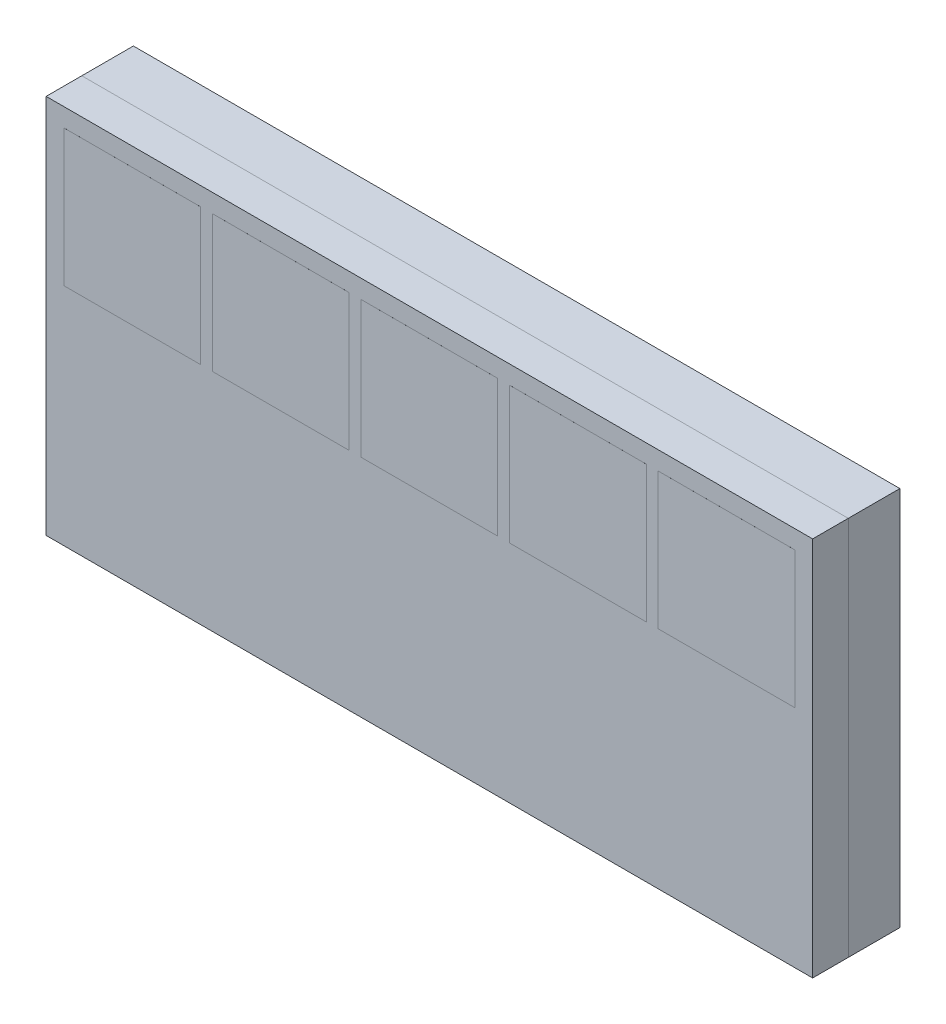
ISO-10303-21;
HEADER;
FILE_DESCRIPTION(('STEP AP214'),'2;1');
FILE_NAME('part.step','',(''),(''),'','','');
FILE_SCHEMA(('AUTOMOTIVE_DESIGN { 1 0 10303 214 1 1 1 1 }'));
ENDSEC;
DATA;
#1=APPLICATION_CONTEXT('core data for automotive mechanical design processes');
#2=APPLICATION_PROTOCOL_DEFINITION('international standard','automotive_design',2000,#1);
#3=PRODUCT_CONTEXT('',#1,'mechanical');
#4=PRODUCT('Part','Part','',(#3));
#5=PRODUCT_RELATED_PRODUCT_CATEGORY('part','',(#4));
#6=PRODUCT_DEFINITION_FORMATION('','',#4);
#7=PRODUCT_DEFINITION_CONTEXT('part definition',#1,'design');
#8=PRODUCT_DEFINITION('design','',#6,#7);
#9=PRODUCT_DEFINITION_SHAPE('','',#8);
#10=(LENGTH_UNIT() NAMED_UNIT(*) SI_UNIT(.MILLI.,.METRE.));
#11=(NAMED_UNIT(*) PLANE_ANGLE_UNIT() SI_UNIT($,.RADIAN.));
#12=(NAMED_UNIT(*) SI_UNIT($,.STERADIAN.) SOLID_ANGLE_UNIT());
#13=UNCERTAINTY_MEASURE_WITH_UNIT(LENGTH_MEASURE(1.E-05),#10,'distance_accuracy_value','');
#14=(GEOMETRIC_REPRESENTATION_CONTEXT(3) GLOBAL_UNCERTAINTY_ASSIGNED_CONTEXT((#13)) GLOBAL_UNIT_ASSIGNED_CONTEXT((#10,
#11,#12)) REPRESENTATION_CONTEXT('',''));
#15=CARTESIAN_POINT('',(0.,0.,0.));
#16=DIRECTION('',(0.,0.,1.));
#17=DIRECTION('',(1.,0.,0.));
#18=AXIS2_PLACEMENT_3D('',#15,#16,#17);
#19=CARTESIAN_POINT('',(0.,0.,-0.734));
#20=DIRECTION('',(0.,0.,-1.));
#21=DIRECTION('',(-1.,0.,0.));
#22=AXIS2_PLACEMENT_3D('',#19,#20,#21);
#23=PLANE('',#22);
#24=DIRECTION('',(1.,0.,0.));
#25=VECTOR('',#24,1.);
#26=CARTESIAN_POINT('',(-3.225,0.73,-0.734));
#27=LINE('',#26,#25);
#28=CARTESIAN_POINT('',(-3.225,0.73,-0.734));
#29=VERTEX_POINT('',#28);
#30=CARTESIAN_POINT('',(3.225,0.73,-0.734));
#31=VERTEX_POINT('',#30);
#32=EDGE_CURVE('E560',#29,#31,#27,.T.);
#33=ORIENTED_EDGE('',*,*,#32,.T.);
#34=DIRECTION('',(0.,-1.,0.));
#35=VECTOR('',#34,1.);
#36=CARTESIAN_POINT('',(3.225,0.73,-0.734));
#37=LINE('',#36,#35);
#38=CARTESIAN_POINT('',(3.225,-2.47,-0.734));
#39=VERTEX_POINT('',#38);
#40=EDGE_CURVE('E564',#31,#39,#37,.T.);
#41=ORIENTED_EDGE('',*,*,#40,.T.);
#42=DIRECTION('',(-1.,0.,0.));
#43=VECTOR('',#42,1.);
#44=CARTESIAN_POINT('',(3.225,-2.47,-0.734));
#45=LINE('',#44,#43);
#46=CARTESIAN_POINT('',(-3.225,-2.47,-0.734));
#47=VERTEX_POINT('',#46);
#48=EDGE_CURVE('E568',#39,#47,#45,.T.);
#49=ORIENTED_EDGE('',*,*,#48,.T.);
#50=DIRECTION('',(0.,1.,0.));
#51=VECTOR('',#50,1.);
#52=CARTESIAN_POINT('',(-3.225,-2.47,-0.734));
#53=LINE('',#52,#51);
#54=EDGE_CURVE('E571',#47,#29,#53,.T.);
#55=ORIENTED_EDGE('',*,*,#54,.T.);
#56=EDGE_LOOP('',(#33,#41,#49,#55));
#57=FACE_BOUND('',#56,.T.);
#58=DIRECTION('',(1.,0.,0.));
#59=VECTOR('',#58,1.);
#60=CARTESIAN_POINT('',(2.45,0.55,-0.734));
#61=LINE('',#60,#59);
#62=CARTESIAN_POINT('',(0.500000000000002,0.55,-0.734));
#63=VERTEX_POINT('',#62);
#64=CARTESIAN_POINT('',(2.45,0.55,-0.734));
#65=VERTEX_POINT('',#64);
#66=EDGE_CURVE('E509',#63,#65,#61,.T.);
#67=ORIENTED_EDGE('',*,*,#66,.F.);
#68=CARTESIAN_POINT('',(0.5,0.25,-0.734));
#69=DIRECTION('',(0.,0.,-1.));
#70=DIRECTION('',(1.,0.,0.));
#71=AXIS2_PLACEMENT_3D('',#68,#69,#70);
#72=CIRCLE('',#71,0.3);
#73=CARTESIAN_POINT('',(0.2,0.249999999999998,-0.734));
#74=VERTEX_POINT('',#73);
#75=EDGE_CURVE('E478',#74,#63,#72,.T.);
#76=ORIENTED_EDGE('',*,*,#75,.F.);
#77=DIRECTION('',(0.,1.,0.));
#78=VECTOR('',#77,1.);
#79=CARTESIAN_POINT('',(0.2,0.249999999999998,-0.734));
#80=LINE('',#79,#78);
#81=CARTESIAN_POINT('',(0.2,-0.369999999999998,-0.734));
#82=VERTEX_POINT('',#81);
#83=EDGE_CURVE('E484',#82,#74,#80,.T.);
#84=ORIENTED_EDGE('',*,*,#83,.F.);
#85=CARTESIAN_POINT('',(0.5,-0.37,-0.734));
#86=DIRECTION('',(0.,0.,-1.));
#87=DIRECTION('',(1.,0.,0.));
#88=AXIS2_PLACEMENT_3D('',#85,#86,#87);
#89=CIRCLE('',#88,0.3);
#90=CARTESIAN_POINT('',(0.500000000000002,-0.67,-0.734));
#91=VERTEX_POINT('',#90);
#92=EDGE_CURVE('E524',#91,#82,#89,.T.);
#93=ORIENTED_EDGE('',*,*,#92,.F.);
#94=DIRECTION('',(-1.,0.,0.));
#95=VECTOR('',#94,1.);
#96=CARTESIAN_POINT('',(2.45,-0.67,-0.734));
#97=LINE('',#96,#95);
#98=CARTESIAN_POINT('',(2.45,-0.67,-0.734));
#99=VERTEX_POINT('',#98);
#100=EDGE_CURVE('E521',#99,#91,#97,.T.);
#101=ORIENTED_EDGE('',*,*,#100,.F.);
#102=CARTESIAN_POINT('',(2.45,-0.37,-0.734));
#103=DIRECTION('',(0.,0.,-1.));
#104=DIRECTION('',(1.,0.,0.));
#105=AXIS2_PLACEMENT_3D('',#102,#103,#104);
#106=CIRCLE('',#105,0.3);
#107=CARTESIAN_POINT('',(2.75,-0.369999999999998,-0.734));
#108=VERTEX_POINT('',#107);
#109=EDGE_CURVE('E518',#108,#99,#106,.T.);
#110=ORIENTED_EDGE('',*,*,#109,.F.);
#111=DIRECTION('',(0.,-1.,0.));
#112=VECTOR('',#111,1.);
#113=CARTESIAN_POINT('',(2.75,0.249999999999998,-0.734));
#114=LINE('',#113,#112);
#115=CARTESIAN_POINT('',(2.75,0.249999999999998,-0.734));
#116=VERTEX_POINT('',#115);
#117=EDGE_CURVE('E515',#116,#108,#114,.T.);
#118=ORIENTED_EDGE('',*,*,#117,.F.);
#119=CARTESIAN_POINT('',(2.45,0.25,-0.734));
#120=DIRECTION('',(0.,0.,-1.));
#121=DIRECTION('',(1.,0.,0.));
#122=AXIS2_PLACEMENT_3D('',#119,#120,#121);
#123=CIRCLE('',#122,0.3);
#124=EDGE_CURVE('E512',#65,#116,#123,.T.);
#125=ORIENTED_EDGE('',*,*,#124,.F.);
#126=EDGE_LOOP('',(#67,#76,#84,#93,#101,#110,#118,#125));
#127=FACE_BOUND('',#126,.T.);
#128=DIRECTION('',(1.,0.,0.));
#129=VECTOR('',#128,1.);
#130=CARTESIAN_POINT('',(-0.500000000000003,0.55,-0.734));
#131=LINE('',#130,#129);
#132=CARTESIAN_POINT('',(-2.45,0.55,-0.734));
#133=VERTEX_POINT('',#132);
#134=CARTESIAN_POINT('',(-0.500000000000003,0.55,-0.734));
#135=VERTEX_POINT('',#134);
#136=EDGE_CURVE('E428',#133,#135,#131,.T.);
#137=ORIENTED_EDGE('',*,*,#136,.F.);
#138=CARTESIAN_POINT('',(-2.45,0.25,-0.734));
#139=DIRECTION('',(0.,0.,-1.));
#140=DIRECTION('',(1.,0.,0.));
#141=AXIS2_PLACEMENT_3D('',#138,#139,#140);
#142=CIRCLE('',#141,0.3);
#143=CARTESIAN_POINT('',(-2.75,0.249999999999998,-0.734));
#144=VERTEX_POINT('',#143);
#145=EDGE_CURVE('E397',#144,#133,#142,.T.);
#146=ORIENTED_EDGE('',*,*,#145,.F.);
#147=DIRECTION('',(0.,1.,0.));
#148=VECTOR('',#147,1.);
#149=CARTESIAN_POINT('',(-2.75,0.249999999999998,-0.734));
#150=LINE('',#149,#148);
#151=CARTESIAN_POINT('',(-2.75,-0.369999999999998,-0.734));
#152=VERTEX_POINT('',#151);
#153=EDGE_CURVE('E403',#152,#144,#150,.T.);
#154=ORIENTED_EDGE('',*,*,#153,.F.);
#155=CARTESIAN_POINT('',(-2.45,-0.37,-0.734));
#156=DIRECTION('',(0.,0.,-1.));
#157=DIRECTION('',(1.,0.,0.));
#158=AXIS2_PLACEMENT_3D('',#155,#156,#157);
#159=CIRCLE('',#158,0.3);
#160=CARTESIAN_POINT('',(-2.45,-0.67,-0.734));
#161=VERTEX_POINT('',#160);
#162=EDGE_CURVE('E443',#161,#152,#159,.T.);
#163=ORIENTED_EDGE('',*,*,#162,.F.);
#164=DIRECTION('',(-1.,0.,0.));
#165=VECTOR('',#164,1.);
#166=CARTESIAN_POINT('',(-0.500000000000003,-0.67,-0.734));
#167=LINE('',#166,#165);
#168=CARTESIAN_POINT('',(-0.500000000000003,-0.67,-0.734));
#169=VERTEX_POINT('',#168);
#170=EDGE_CURVE('E440',#169,#161,#167,.T.);
#171=ORIENTED_EDGE('',*,*,#170,.F.);
#172=CARTESIAN_POINT('',(-0.500000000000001,-0.37,-0.734));
#173=DIRECTION('',(0.,0.,-1.));
#174=DIRECTION('',(1.,0.,0.));
#175=AXIS2_PLACEMENT_3D('',#172,#173,#174);
#176=CIRCLE('',#175,0.3);
#177=CARTESIAN_POINT('',(-0.200000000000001,-0.369999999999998,-0.734));
#178=VERTEX_POINT('',#177);
#179=EDGE_CURVE('E437',#178,#169,#176,.T.);
#180=ORIENTED_EDGE('',*,*,#179,.F.);
#181=DIRECTION('',(0.,-1.,0.));
#182=VECTOR('',#181,1.);
#183=CARTESIAN_POINT('',(-0.200000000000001,0.249999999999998,-0.734));
#184=LINE('',#183,#182);
#185=CARTESIAN_POINT('',(-0.200000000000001,0.249999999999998,-0.734));
#186=VERTEX_POINT('',#185);
#187=EDGE_CURVE('E434',#186,#178,#184,.T.);
#188=ORIENTED_EDGE('',*,*,#187,.F.);
#189=CARTESIAN_POINT('',(-0.500000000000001,0.25,-0.734));
#190=DIRECTION('',(0.,0.,-1.));
#191=DIRECTION('',(1.,0.,0.));
#192=AXIS2_PLACEMENT_3D('',#189,#190,#191);
#193=CIRCLE('',#192,0.3);
#194=EDGE_CURVE('E431',#135,#186,#193,.T.);
#195=ORIENTED_EDGE('',*,*,#194,.F.);
#196=EDGE_LOOP('',(#137,#146,#154,#163,#171,#180,#188,#195));
#197=FACE_BOUND('',#196,.T.);
#198=DIRECTION('',(0.,-1.,0.));
#199=VECTOR('',#198,1.);
#200=CARTESIAN_POINT('',(-0.200000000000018,-1.47,-0.734));
#201=LINE('',#200,#199);
#202=CARTESIAN_POINT('',(-0.200000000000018,-1.47,-0.734));
#203=VERTEX_POINT('',#202);
#204=CARTESIAN_POINT('',(-0.200000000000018,-1.99,-0.734));
#205=VERTEX_POINT('',#204);
#206=EDGE_CURVE('E317',#203,#205,#201,.T.);
#207=ORIENTED_EDGE('',*,*,#206,.F.);
#208=DIRECTION('',(0.707106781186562,-0.707106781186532,0.));
#209=VECTOR('',#208,1.);
#210=CARTESIAN_POINT('',(-0.200000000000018,-1.47,-0.734));
#211=LINE('',#210,#209);
#212=CARTESIAN_POINT('',(-0.600000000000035,-1.07,-0.734));
#213=VERTEX_POINT('',#212);
#214=EDGE_CURVE('E312',#213,#203,#211,.T.);
#215=ORIENTED_EDGE('',*,*,#214,.F.);
#216=DIRECTION('',(1.,0.,0.));
#217=VECTOR('',#216,1.);
#218=CARTESIAN_POINT('',(-0.600000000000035,-1.07,-0.734));
#219=LINE('',#218,#217);
#220=CARTESIAN_POINT('',(-2.45000000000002,-1.07,-0.734));
#221=VERTEX_POINT('',#220);
#222=EDGE_CURVE('E328',#221,#213,#219,.T.);
#223=ORIENTED_EDGE('',*,*,#222,.F.);
#224=CARTESIAN_POINT('',(-2.45000000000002,-1.37,-0.734));
#225=DIRECTION('',(0.,0.,-1.));
#226=DIRECTION('',(1.,0.,0.));
#227=AXIS2_PLACEMENT_3D('',#224,#225,#226);
#228=CIRCLE('',#227,0.3);
#229=CARTESIAN_POINT('',(-2.75000000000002,-1.37,-0.734));
#230=VERTEX_POINT('',#229);
#231=EDGE_CURVE('E364',#230,#221,#228,.T.);
#232=ORIENTED_EDGE('',*,*,#231,.F.);
#233=DIRECTION('',(0.,1.,0.));
#234=VECTOR('',#233,1.);
#235=CARTESIAN_POINT('',(-2.75000000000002,-1.37,-0.734));
#236=LINE('',#235,#234);
#237=CARTESIAN_POINT('',(-2.75000000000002,-1.99,-0.734));
#238=VERTEX_POINT('',#237);
#239=EDGE_CURVE('E361',#238,#230,#236,.T.);
#240=ORIENTED_EDGE('',*,*,#239,.F.);
#241=CARTESIAN_POINT('',(-2.45000000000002,-1.99,-0.734));
#242=DIRECTION('',(0.,0.,-1.));
#243=DIRECTION('',(1.,0.,0.));
#244=AXIS2_PLACEMENT_3D('',#241,#242,#243);
#245=CIRCLE('',#244,0.3);
#246=CARTESIAN_POINT('',(-2.45000000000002,-2.29,-0.734));
#247=VERTEX_POINT('',#246);
#248=EDGE_CURVE('E358',#247,#238,#245,.T.);
#249=ORIENTED_EDGE('',*,*,#248,.F.);
#250=DIRECTION('',(-1.,0.,0.));
#251=VECTOR('',#250,1.);
#252=CARTESIAN_POINT('',(-0.50000000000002,-2.29,-0.734));
#253=LINE('',#252,#251);
#254=CARTESIAN_POINT('',(-0.50000000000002,-2.29,-0.734));
#255=VERTEX_POINT('',#254);
#256=EDGE_CURVE('E355',#255,#247,#253,.T.);
#257=ORIENTED_EDGE('',*,*,#256,.F.);
#258=CARTESIAN_POINT('',(-0.500000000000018,-1.99,-0.734));
#259=DIRECTION('',(0.,0.,-1.));
#260=DIRECTION('',(1.,0.,0.));
#261=AXIS2_PLACEMENT_3D('',#258,#259,#260);
#262=CIRCLE('',#261,0.3);
#263=EDGE_CURVE('E352',#205,#255,#262,.T.);
#264=ORIENTED_EDGE('',*,*,#263,.F.);
#265=EDGE_LOOP('',(#207,#215,#223,#232,#240,#249,#257,#264));
#266=FACE_BOUND('',#265,.T.);
#267=DIRECTION('',(1.,0.,0.));
#268=VECTOR('',#267,1.);
#269=CARTESIAN_POINT('',(2.44999999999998,-1.07,-0.734));
#270=LINE('',#269,#268);
#271=CARTESIAN_POINT('',(0.499999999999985,-1.07,-0.734));
#272=VERTEX_POINT('',#271);
#273=CARTESIAN_POINT('',(2.44999999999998,-1.07,-0.734));
#274=VERTEX_POINT('',#273);
#275=EDGE_CURVE('E1023',#272,#274,#270,.T.);
#276=ORIENTED_EDGE('',*,*,#275,.F.);
#277=CARTESIAN_POINT('',(0.499999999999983,-1.37,-0.734));
#278=DIRECTION('',(0.,0.,-1.));
#279=DIRECTION('',(1.,0.,0.));
#280=AXIS2_PLACEMENT_3D('',#277,#278,#279);
#281=CIRCLE('',#280,0.3);
#282=CARTESIAN_POINT('',(0.199999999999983,-1.37,-0.734));
#283=VERTEX_POINT('',#282);
#284=EDGE_CURVE('E309',#283,#272,#281,.T.);
#285=ORIENTED_EDGE('',*,*,#284,.F.);
#286=DIRECTION('',(0.,1.,0.));
#287=VECTOR('',#286,1.);
#288=CARTESIAN_POINT('',(0.199999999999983,-1.37,-0.734));
#289=LINE('',#288,#287);
#290=CARTESIAN_POINT('',(0.199999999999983,-1.99,-0.734));
#291=VERTEX_POINT('',#290);
#292=EDGE_CURVE('E305',#291,#283,#289,.T.);
#293=ORIENTED_EDGE('',*,*,#292,.F.);
#294=CARTESIAN_POINT('',(0.499999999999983,-1.99,-0.734));
#295=DIRECTION('',(0.,0.,-1.));
#296=DIRECTION('',(1.,0.,0.));
#297=AXIS2_PLACEMENT_3D('',#294,#295,#296);
#298=CIRCLE('',#297,0.3);
#299=CARTESIAN_POINT('',(0.499999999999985,-2.29,-0.734));
#300=VERTEX_POINT('',#299);
#301=EDGE_CURVE('E1018',#300,#291,#298,.T.);
#302=ORIENTED_EDGE('',*,*,#301,.F.);
#303=DIRECTION('',(-1.,0.,0.));
#304=VECTOR('',#303,1.);
#305=CARTESIAN_POINT('',(2.44999999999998,-2.29,-0.734));
#306=LINE('',#305,#304);
#307=CARTESIAN_POINT('',(2.44999999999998,-2.29,-0.734));
#308=VERTEX_POINT('',#307);
#309=EDGE_CURVE('E1040',#308,#300,#306,.T.);
#310=ORIENTED_EDGE('',*,*,#309,.F.);
#311=CARTESIAN_POINT('',(2.44999999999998,-1.99,-0.734));
#312=DIRECTION('',(0.,0.,-1.));
#313=DIRECTION('',(1.,0.,0.));
#314=AXIS2_PLACEMENT_3D('',#311,#312,#313);
#315=CIRCLE('',#314,0.3);
#316=CARTESIAN_POINT('',(2.74999999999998,-1.99,-0.734));
#317=VERTEX_POINT('',#316);
#318=EDGE_CURVE('E1037',#317,#308,#315,.T.);
#319=ORIENTED_EDGE('',*,*,#318,.F.);
#320=DIRECTION('',(0.,-1.,0.));
#321=VECTOR('',#320,1.);
#322=CARTESIAN_POINT('',(2.74999999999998,-1.37,-0.734));
#323=LINE('',#322,#321);
#324=CARTESIAN_POINT('',(2.74999999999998,-1.37,-0.734));
#325=VERTEX_POINT('',#324);
#326=EDGE_CURVE('E1034',#325,#317,#323,.T.);
#327=ORIENTED_EDGE('',*,*,#326,.F.);
#328=CARTESIAN_POINT('',(2.44999999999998,-1.37,-0.734));
#329=DIRECTION('',(0.,0.,-1.));
#330=DIRECTION('',(1.,0.,0.));
#331=AXIS2_PLACEMENT_3D('',#328,#329,#330);
#332=CIRCLE('',#331,0.3);
#333=EDGE_CURVE('E1027',#274,#325,#332,.T.);
#334=ORIENTED_EDGE('',*,*,#333,.F.);
#335=EDGE_LOOP('',(#276,#285,#293,#302,#310,#319,#327,#334));
#336=FACE_BOUND('',#335,.T.);
#337=ADVANCED_FACE('F49',(#57,#127,#197,#266,#336),#23,.T.);
#338=CARTESIAN_POINT('',(-3.225,0.73,-0.734));
#339=DIRECTION('',(0.,-1.,0.));
#340=DIRECTION('',(0.,0.,-1.));
#341=AXIS2_PLACEMENT_3D('',#338,#339,#340);
#342=PLANE('',#341);
#343=DIRECTION('',(1.,0.,0.));
#344=VECTOR('',#343,1.);
#345=CARTESIAN_POINT('',(-3.225,0.73,-0.3));
#346=LINE('',#345,#344);
#347=CARTESIAN_POINT('',(-3.225,0.73,-0.3));
#348=VERTEX_POINT('',#347);
#349=CARTESIAN_POINT('',(3.225,0.73,-0.3));
#350=VERTEX_POINT('',#349);
#351=EDGE_CURVE('E559',#348,#350,#346,.T.);
#352=ORIENTED_EDGE('',*,*,#351,.T.);
#353=DIRECTION('',(0.,0.,1.));
#354=VECTOR('',#353,1.);
#355=CARTESIAN_POINT('',(3.225,0.73,-0.734));
#356=LINE('',#355,#354);
#357=EDGE_CURVE('E12',#31,#350,#356,.T.);
#358=ORIENTED_EDGE('',*,*,#357,.F.);
#359=ORIENTED_EDGE('',*,*,#32,.F.);
#360=DIRECTION('',(0.,0.,1.));
#361=VECTOR('',#360,1.);
#362=CARTESIAN_POINT('',(-3.225,0.73,-0.734));
#363=LINE('',#362,#361);
#364=EDGE_CURVE('E574',#29,#348,#363,.T.);
#365=ORIENTED_EDGE('',*,*,#364,.T.);
#366=EDGE_LOOP('',(#352,#358,#359,#365));
#367=FACE_BOUND('',#366,.T.);
#368=ADVANCED_FACE('F51',(#367),#342,.F.);
#369=CARTESIAN_POINT('',(3.225,0.73,-0.734));
#370=DIRECTION('',(-1.,0.,0.));
#371=DIRECTION('',(0.,-1.,0.));
#372=AXIS2_PLACEMENT_3D('',#369,#370,#371);
#373=PLANE('',#372);
#374=DIRECTION('',(0.,-1.,0.));
#375=VECTOR('',#374,1.);
#376=CARTESIAN_POINT('',(3.225,0.73,-0.3));
#377=LINE('',#376,#375);
#378=CARTESIAN_POINT('',(3.225,-2.47,-0.3));
#379=VERTEX_POINT('',#378);
#380=EDGE_CURVE('E578',#350,#379,#377,.T.);
#381=ORIENTED_EDGE('',*,*,#380,.T.);
#382=DIRECTION('',(0.,0.,1.));
#383=VECTOR('',#382,1.);
#384=CARTESIAN_POINT('',(3.225,-2.47,-0.734));
#385=LINE('',#384,#383);
#386=EDGE_CURVE('E58',#39,#379,#385,.T.);
#387=ORIENTED_EDGE('',*,*,#386,.F.);
#388=ORIENTED_EDGE('',*,*,#40,.F.);
#389=ORIENTED_EDGE('',*,*,#357,.T.);
#390=EDGE_LOOP('',(#381,#387,#388,#389));
#391=FACE_BOUND('',#390,.T.);
#392=ADVANCED_FACE('F614',(#391),#373,.F.);
#393=CARTESIAN_POINT('',(3.225,-2.47,-0.734));
#394=DIRECTION('',(0.,1.,0.));
#395=DIRECTION('',(0.,0.,1.));
#396=AXIS2_PLACEMENT_3D('',#393,#394,#395);
#397=PLANE('',#396);
#398=DIRECTION('',(-1.,0.,0.));
#399=VECTOR('',#398,1.);
#400=CARTESIAN_POINT('',(3.225,-2.47,-0.3));
#401=LINE('',#400,#399);
#402=CARTESIAN_POINT('',(-3.225,-2.47,-0.3));
#403=VERTEX_POINT('',#402);
#404=EDGE_CURVE('E581',#379,#403,#401,.T.);
#405=ORIENTED_EDGE('',*,*,#404,.T.);
#406=DIRECTION('',(0.,0.,1.));
#407=VECTOR('',#406,1.);
#408=CARTESIAN_POINT('',(-3.225,-2.47,-0.734));
#409=LINE('',#408,#407);
#410=EDGE_CURVE('E589',#47,#403,#409,.T.);
#411=ORIENTED_EDGE('',*,*,#410,.F.);
#412=ORIENTED_EDGE('',*,*,#48,.F.);
#413=ORIENTED_EDGE('',*,*,#386,.T.);
#414=EDGE_LOOP('',(#405,#411,#412,#413));
#415=FACE_BOUND('',#414,.T.);
#416=ADVANCED_FACE('F598',(#415),#397,.F.);
#417=CARTESIAN_POINT('',(-3.225,-2.47,-0.734));
#418=DIRECTION('',(1.,0.,0.));
#419=DIRECTION('',(0.,1.,0.));
#420=AXIS2_PLACEMENT_3D('',#417,#418,#419);
#421=PLANE('',#420);
#422=DIRECTION('',(0.,1.,0.));
#423=VECTOR('',#422,1.);
#424=CARTESIAN_POINT('',(-3.225,-2.47,-0.3));
#425=LINE('',#424,#423);
#426=EDGE_CURVE('E565',#403,#348,#425,.T.);
#427=ORIENTED_EDGE('',*,*,#426,.T.);
#428=ORIENTED_EDGE('',*,*,#364,.F.);
#429=ORIENTED_EDGE('',*,*,#54,.F.);
#430=ORIENTED_EDGE('',*,*,#410,.T.);
#431=EDGE_LOOP('',(#427,#428,#429,#430));
#432=FACE_BOUND('',#431,.T.);
#433=ADVANCED_FACE('F607',(#432),#421,.F.);
#434=CARTESIAN_POINT('',(0.,0.,-0.3));
#435=DIRECTION('',(0.,0.,-1.));
#436=DIRECTION('',(-1.,0.,0.));
#437=AXIS2_PLACEMENT_3D('',#434,#435,#436);
#438=PLANE('',#437);
#439=ORIENTED_EDGE('',*,*,#351,.F.);
#440=ORIENTED_EDGE('',*,*,#426,.F.);
#441=ORIENTED_EDGE('',*,*,#404,.F.);
#442=ORIENTED_EDGE('',*,*,#380,.F.);
#443=EDGE_LOOP('',(#439,#440,#441,#442));
#444=FACE_BOUND('',#443,.T.);
#445=ADVANCED_FACE('F604',(#444),#438,.F.);
#446=CARTESIAN_POINT('',(0.5,0.25,-0.79));
#447=DIRECTION('',(0.,0.,1.));
#448=DIRECTION('',(1.,0.,0.));
#449=AXIS2_PLACEMENT_3D('',#446,#447,#448);
#450=CYLINDRICAL_SURFACE('',#449,0.3);
#451=ORIENTED_EDGE('',*,*,#75,.T.);
#452=DIRECTION('',(0.,0.,1.));
#453=VECTOR('',#452,1.);
#454=CARTESIAN_POINT('',(0.500000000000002,0.55,-0.79));
#455=LINE('',#454,#453);
#456=CARTESIAN_POINT('',(0.500000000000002,0.55,-0.79));
#457=VERTEX_POINT('',#456);
#458=EDGE_CURVE('E556',#457,#63,#455,.T.);
#459=ORIENTED_EDGE('',*,*,#458,.F.);
#460=CARTESIAN_POINT('',(0.5,0.25,-0.79));
#461=DIRECTION('',(0.,0.,-1.));
#462=DIRECTION('',(1.,0.,0.));
#463=AXIS2_PLACEMENT_3D('',#460,#461,#462);
#464=CIRCLE('',#463,0.3);
#465=CARTESIAN_POINT('',(0.2,0.249999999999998,-0.79));
#466=VERTEX_POINT('',#465);
#467=EDGE_CURVE('E479',#466,#457,#464,.T.);
#468=ORIENTED_EDGE('',*,*,#467,.F.);
#469=DIRECTION('',(0.,0.,1.));
#470=VECTOR('',#469,1.);
#471=CARTESIAN_POINT('',(0.2,0.249999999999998,-0.79));
#472=LINE('',#471,#470);
#473=EDGE_CURVE('E505',#466,#74,#472,.T.);
#474=ORIENTED_EDGE('',*,*,#473,.T.);
#475=EDGE_LOOP('',(#451,#459,#468,#474));
#476=FACE_BOUND('',#475,.T.);
#477=ADVANCED_FACE('F627',(#476),#450,.T.);
#478=CARTESIAN_POINT('',(2.45,0.55,-0.79));
#479=DIRECTION('',(0.,-1.,0.));
#480=DIRECTION('',(0.,0.,-1.));
#481=AXIS2_PLACEMENT_3D('',#478,#479,#480);
#482=PLANE('',#481);
#483=ORIENTED_EDGE('',*,*,#66,.T.);
#484=DIRECTION('',(0.,0.,1.));
#485=VECTOR('',#484,1.);
#486=CARTESIAN_POINT('',(2.45,0.55,-0.79));
#487=LINE('',#486,#485);
#488=CARTESIAN_POINT('',(2.45,0.55,-0.79));
#489=VERTEX_POINT('',#488);
#490=EDGE_CURVE('E552',#489,#65,#487,.T.);
#491=ORIENTED_EDGE('',*,*,#490,.F.);
#492=DIRECTION('',(1.,0.,0.));
#493=VECTOR('',#492,1.);
#494=CARTESIAN_POINT('',(2.45,0.55,-0.79));
#495=LINE('',#494,#493);
#496=EDGE_CURVE('E483',#457,#489,#495,.T.);
#497=ORIENTED_EDGE('',*,*,#496,.F.);
#498=ORIENTED_EDGE('',*,*,#458,.T.);
#499=EDGE_LOOP('',(#483,#491,#497,#498));
#500=FACE_BOUND('',#499,.T.);
#501=ADVANCED_FACE('F646',(#500),#482,.F.);
#502=CARTESIAN_POINT('',(2.45,0.25,-0.79));
#503=DIRECTION('',(0.,0.,1.));
#504=DIRECTION('',(1.,0.,0.));
#505=AXIS2_PLACEMENT_3D('',#502,#503,#504);
#506=CYLINDRICAL_SURFACE('',#505,0.3);
#507=ORIENTED_EDGE('',*,*,#124,.T.);
#508=DIRECTION('',(0.,0.,1.));
#509=VECTOR('',#508,1.);
#510=CARTESIAN_POINT('',(2.75,0.249999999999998,-0.79));
#511=LINE('',#510,#509);
#512=CARTESIAN_POINT('',(2.75,0.249999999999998,-0.79));
#513=VERTEX_POINT('',#512);
#514=EDGE_CURVE('E548',#513,#116,#511,.T.);
#515=ORIENTED_EDGE('',*,*,#514,.F.);
#516=CARTESIAN_POINT('',(2.45,0.25,-0.79));
#517=DIRECTION('',(0.,0.,-1.));
#518=DIRECTION('',(1.,0.,0.));
#519=AXIS2_PLACEMENT_3D('',#516,#517,#518);
#520=CIRCLE('',#519,0.3);
#521=EDGE_CURVE('E487',#489,#513,#520,.T.);
#522=ORIENTED_EDGE('',*,*,#521,.F.);
#523=ORIENTED_EDGE('',*,*,#490,.T.);
#524=EDGE_LOOP('',(#507,#515,#522,#523));
#525=FACE_BOUND('',#524,.T.);
#526=ADVANCED_FACE('F653',(#525),#506,.T.);
#527=CARTESIAN_POINT('',(2.75,0.249999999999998,-0.79));
#528=DIRECTION('',(-1.,0.,0.));
#529=DIRECTION('',(0.,0.,1.));
#530=AXIS2_PLACEMENT_3D('',#527,#528,#529);
#531=PLANE('',#530);
#532=ORIENTED_EDGE('',*,*,#117,.T.);
#533=DIRECTION('',(0.,0.,1.));
#534=VECTOR('',#533,1.);
#535=CARTESIAN_POINT('',(2.75,-0.369999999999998,-0.79));
#536=LINE('',#535,#534);
#537=CARTESIAN_POINT('',(2.75,-0.369999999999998,-0.79));
#538=VERTEX_POINT('',#537);
#539=EDGE_CURVE('E544',#538,#108,#536,.T.);
#540=ORIENTED_EDGE('',*,*,#539,.F.);
#541=DIRECTION('',(0.,-1.,0.));
#542=VECTOR('',#541,1.);
#543=CARTESIAN_POINT('',(2.75,0.249999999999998,-0.79));
#544=LINE('',#543,#542);
#545=EDGE_CURVE('E490',#513,#538,#544,.T.);
#546=ORIENTED_EDGE('',*,*,#545,.F.);
#547=ORIENTED_EDGE('',*,*,#514,.T.);
#548=EDGE_LOOP('',(#532,#540,#546,#547));
#549=FACE_BOUND('',#548,.T.);
#550=ADVANCED_FACE('F660',(#549),#531,.F.);
#551=CARTESIAN_POINT('',(2.45,-0.37,-0.79));
#552=DIRECTION('',(0.,0.,1.));
#553=DIRECTION('',(1.,0.,0.));
#554=AXIS2_PLACEMENT_3D('',#551,#552,#553);
#555=CYLINDRICAL_SURFACE('',#554,0.3);
#556=ORIENTED_EDGE('',*,*,#109,.T.);
#557=DIRECTION('',(0.,0.,1.));
#558=VECTOR('',#557,1.);
#559=CARTESIAN_POINT('',(2.45,-0.67,-0.79));
#560=LINE('',#559,#558);
#561=CARTESIAN_POINT('',(2.45,-0.67,-0.79));
#562=VERTEX_POINT('',#561);
#563=EDGE_CURVE('E540',#562,#99,#560,.T.);
#564=ORIENTED_EDGE('',*,*,#563,.F.);
#565=CARTESIAN_POINT('',(2.45,-0.37,-0.79));
#566=DIRECTION('',(0.,0.,-1.));
#567=DIRECTION('',(1.,0.,0.));
#568=AXIS2_PLACEMENT_3D('',#565,#566,#567);
#569=CIRCLE('',#568,0.3);
#570=EDGE_CURVE('E493',#538,#562,#569,.T.);
#571=ORIENTED_EDGE('',*,*,#570,.F.);
#572=ORIENTED_EDGE('',*,*,#539,.T.);
#573=EDGE_LOOP('',(#556,#564,#571,#572));
#574=FACE_BOUND('',#573,.T.);
#575=ADVANCED_FACE('F668',(#574),#555,.T.);
#576=CARTESIAN_POINT('',(2.45,-0.67,-0.79));
#577=DIRECTION('',(0.,1.,0.));
#578=DIRECTION('',(0.,0.,1.));
#579=AXIS2_PLACEMENT_3D('',#576,#577,#578);
#580=PLANE('',#579);
#581=ORIENTED_EDGE('',*,*,#100,.T.);
#582=DIRECTION('',(0.,0.,1.));
#583=VECTOR('',#582,1.);
#584=CARTESIAN_POINT('',(0.500000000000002,-0.67,-0.79));
#585=LINE('',#584,#583);
#586=CARTESIAN_POINT('',(0.500000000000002,-0.67,-0.79));
#587=VERTEX_POINT('',#586);
#588=EDGE_CURVE('E536',#587,#91,#585,.T.);
#589=ORIENTED_EDGE('',*,*,#588,.F.);
#590=DIRECTION('',(-1.,0.,0.));
#591=VECTOR('',#590,1.);
#592=CARTESIAN_POINT('',(2.45,-0.67,-0.79));
#593=LINE('',#592,#591);
#594=EDGE_CURVE('E496',#562,#587,#593,.T.);
#595=ORIENTED_EDGE('',*,*,#594,.F.);
#596=ORIENTED_EDGE('',*,*,#563,.T.);
#597=EDGE_LOOP('',(#581,#589,#595,#596));
#598=FACE_BOUND('',#597,.T.);
#599=ADVANCED_FACE('F676',(#598),#580,.F.);
#600=CARTESIAN_POINT('',(0.5,-0.37,-0.79));
#601=DIRECTION('',(0.,0.,1.));
#602=DIRECTION('',(1.,0.,0.));
#603=AXIS2_PLACEMENT_3D('',#600,#601,#602);
#604=CYLINDRICAL_SURFACE('',#603,0.3);
#605=ORIENTED_EDGE('',*,*,#92,.T.);
#606=DIRECTION('',(0.,0.,1.));
#607=VECTOR('',#606,1.);
#608=CARTESIAN_POINT('',(0.2,-0.369999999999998,-0.79));
#609=LINE('',#608,#607);
#610=CARTESIAN_POINT('',(0.2,-0.369999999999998,-0.79));
#611=VERTEX_POINT('',#610);
#612=EDGE_CURVE('E533',#611,#82,#609,.T.);
#613=ORIENTED_EDGE('',*,*,#612,.F.);
#614=CARTESIAN_POINT('',(0.5,-0.37,-0.79));
#615=DIRECTION('',(0.,0.,-1.));
#616=DIRECTION('',(1.,0.,0.));
#617=AXIS2_PLACEMENT_3D('',#614,#615,#616);
#618=CIRCLE('',#617,0.3);
#619=EDGE_CURVE('E499',#587,#611,#618,.T.);
#620=ORIENTED_EDGE('',*,*,#619,.F.);
#621=ORIENTED_EDGE('',*,*,#588,.T.);
#622=EDGE_LOOP('',(#605,#613,#620,#621));
#623=FACE_BOUND('',#622,.T.);
#624=ADVANCED_FACE('F684',(#623),#604,.T.);
#625=CARTESIAN_POINT('',(0.2,0.249999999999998,-0.79));
#626=DIRECTION('',(1.,0.,0.));
#627=DIRECTION('',(0.,0.,-1.));
#628=AXIS2_PLACEMENT_3D('',#625,#626,#627);
#629=PLANE('',#628);
#630=ORIENTED_EDGE('',*,*,#83,.T.);
#631=ORIENTED_EDGE('',*,*,#473,.F.);
#632=DIRECTION('',(0.,1.,0.));
#633=VECTOR('',#632,1.);
#634=CARTESIAN_POINT('',(0.2,0.249999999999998,-0.79));
#635=LINE('',#634,#633);
#636=EDGE_CURVE('E502',#611,#466,#635,.T.);
#637=ORIENTED_EDGE('',*,*,#636,.F.);
#638=ORIENTED_EDGE('',*,*,#612,.T.);
#639=EDGE_LOOP('',(#630,#631,#637,#638));
#640=FACE_BOUND('',#639,.T.);
#641=ADVANCED_FACE('F692',(#640),#629,.F.);
#642=CARTESIAN_POINT('',(0.5,0.25,-0.79));
#643=DIRECTION('',(0.,0.,1.));
#644=DIRECTION('',(1.,0.,0.));
#645=AXIS2_PLACEMENT_3D('',#642,#643,#644);
#646=PLANE('',#645);
#647=ORIENTED_EDGE('',*,*,#467,.T.);
#648=ORIENTED_EDGE('',*,*,#496,.T.);
#649=ORIENTED_EDGE('',*,*,#521,.T.);
#650=ORIENTED_EDGE('',*,*,#545,.T.);
#651=ORIENTED_EDGE('',*,*,#570,.T.);
#652=ORIENTED_EDGE('',*,*,#594,.T.);
#653=ORIENTED_EDGE('',*,*,#619,.T.);
#654=ORIENTED_EDGE('',*,*,#636,.T.);
#655=EDGE_LOOP('',(#647,#648,#649,#650,#651,#652,#653,#654));
#656=FACE_BOUND('',#655,.T.);
#657=ADVANCED_FACE('F700',(#656),#646,.F.);
#658=CARTESIAN_POINT('',(-2.45,0.25,-0.79));
#659=DIRECTION('',(0.,0.,1.));
#660=DIRECTION('',(1.,0.,0.));
#661=AXIS2_PLACEMENT_3D('',#658,#659,#660);
#662=CYLINDRICAL_SURFACE('',#661,0.3);
#663=ORIENTED_EDGE('',*,*,#145,.T.);
#664=DIRECTION('',(0.,0.,1.));
#665=VECTOR('',#664,1.);
#666=CARTESIAN_POINT('',(-2.45,0.55,-0.79));
#667=LINE('',#666,#665);
#668=CARTESIAN_POINT('',(-2.45,0.55,-0.79));
#669=VERTEX_POINT('',#668);
#670=EDGE_CURVE('E475',#669,#133,#667,.T.);
#671=ORIENTED_EDGE('',*,*,#670,.F.);
#672=CARTESIAN_POINT('',(-2.45,0.25,-0.79));
#673=DIRECTION('',(0.,0.,-1.));
#674=DIRECTION('',(1.,0.,0.));
#675=AXIS2_PLACEMENT_3D('',#672,#673,#674);
#676=CIRCLE('',#675,0.3);
#677=CARTESIAN_POINT('',(-2.75,0.249999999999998,-0.79));
#678=VERTEX_POINT('',#677);
#679=EDGE_CURVE('E398',#678,#669,#676,.T.);
#680=ORIENTED_EDGE('',*,*,#679,.F.);
#681=DIRECTION('',(0.,0.,1.));
#682=VECTOR('',#681,1.);
#683=CARTESIAN_POINT('',(-2.75,0.249999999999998,-0.79));
#684=LINE('',#683,#682);
#685=EDGE_CURVE('E424',#678,#144,#684,.T.);
#686=ORIENTED_EDGE('',*,*,#685,.T.);
#687=EDGE_LOOP('',(#663,#671,#680,#686));
#688=FACE_BOUND('',#687,.T.);
#689=ADVANCED_FACE('F708',(#688),#662,.T.);
#690=CARTESIAN_POINT('',(-0.500000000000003,0.55,-0.79));
#691=DIRECTION('',(0.,-1.,0.));
#692=DIRECTION('',(0.,0.,-1.));
#693=AXIS2_PLACEMENT_3D('',#690,#691,#692);
#694=PLANE('',#693);
#695=ORIENTED_EDGE('',*,*,#136,.T.);
#696=DIRECTION('',(0.,0.,1.));
#697=VECTOR('',#696,1.);
#698=CARTESIAN_POINT('',(-0.500000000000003,0.55,-0.79));
#699=LINE('',#698,#697);
#700=CARTESIAN_POINT('',(-0.500000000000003,0.55,-0.79));
#701=VERTEX_POINT('',#700);
#702=EDGE_CURVE('E471',#701,#135,#699,.T.);
#703=ORIENTED_EDGE('',*,*,#702,.F.);
#704=DIRECTION('',(1.,0.,0.));
#705=VECTOR('',#704,1.);
#706=CARTESIAN_POINT('',(-0.500000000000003,0.55,-0.79));
#707=LINE('',#706,#705);
#708=EDGE_CURVE('E402',#669,#701,#707,.T.);
#709=ORIENTED_EDGE('',*,*,#708,.F.);
#710=ORIENTED_EDGE('',*,*,#670,.T.);
#711=EDGE_LOOP('',(#695,#703,#709,#710));
#712=FACE_BOUND('',#711,.T.);
#713=ADVANCED_FACE('F716',(#712),#694,.F.);
#714=CARTESIAN_POINT('',(-0.500000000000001,0.25,-0.79));
#715=DIRECTION('',(0.,0.,1.));
#716=DIRECTION('',(1.,0.,0.));
#717=AXIS2_PLACEMENT_3D('',#714,#715,#716);
#718=CYLINDRICAL_SURFACE('',#717,0.3);
#719=ORIENTED_EDGE('',*,*,#194,.T.);
#720=DIRECTION('',(0.,0.,1.));
#721=VECTOR('',#720,1.);
#722=CARTESIAN_POINT('',(-0.200000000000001,0.249999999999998,-0.79));
#723=LINE('',#722,#721);
#724=CARTESIAN_POINT('',(-0.200000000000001,0.249999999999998,-0.79));
#725=VERTEX_POINT('',#724);
#726=EDGE_CURVE('E467',#725,#186,#723,.T.);
#727=ORIENTED_EDGE('',*,*,#726,.F.);
#728=CARTESIAN_POINT('',(-0.500000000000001,0.25,-0.79));
#729=DIRECTION('',(0.,0.,-1.));
#730=DIRECTION('',(1.,0.,0.));
#731=AXIS2_PLACEMENT_3D('',#728,#729,#730);
#732=CIRCLE('',#731,0.3);
#733=EDGE_CURVE('E406',#701,#725,#732,.T.);
#734=ORIENTED_EDGE('',*,*,#733,.F.);
#735=ORIENTED_EDGE('',*,*,#702,.T.);
#736=EDGE_LOOP('',(#719,#727,#734,#735));
#737=FACE_BOUND('',#736,.T.);
#738=ADVANCED_FACE('F724',(#737),#718,.T.);
#739=CARTESIAN_POINT('',(-0.200000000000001,0.249999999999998,-0.79));
#740=DIRECTION('',(-1.,0.,0.));
#741=DIRECTION('',(0.,0.,1.));
#742=AXIS2_PLACEMENT_3D('',#739,#740,#741);
#743=PLANE('',#742);
#744=ORIENTED_EDGE('',*,*,#187,.T.);
#745=DIRECTION('',(0.,0.,1.));
#746=VECTOR('',#745,1.);
#747=CARTESIAN_POINT('',(-0.200000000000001,-0.369999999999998,-0.79));
#748=LINE('',#747,#746);
#749=CARTESIAN_POINT('',(-0.200000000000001,-0.369999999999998,-0.79));
#750=VERTEX_POINT('',#749);
#751=EDGE_CURVE('E463',#750,#178,#748,.T.);
#752=ORIENTED_EDGE('',*,*,#751,.F.);
#753=DIRECTION('',(0.,-1.,0.));
#754=VECTOR('',#753,1.);
#755=CARTESIAN_POINT('',(-0.200000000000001,0.249999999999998,-0.79));
#756=LINE('',#755,#754);
#757=EDGE_CURVE('E409',#725,#750,#756,.T.);
#758=ORIENTED_EDGE('',*,*,#757,.F.);
#759=ORIENTED_EDGE('',*,*,#726,.T.);
#760=EDGE_LOOP('',(#744,#752,#758,#759));
#761=FACE_BOUND('',#760,.T.);
#762=ADVANCED_FACE('F732',(#761),#743,.F.);
#763=CARTESIAN_POINT('',(-0.500000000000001,-0.37,-0.79));
#764=DIRECTION('',(0.,0.,1.));
#765=DIRECTION('',(1.,0.,0.));
#766=AXIS2_PLACEMENT_3D('',#763,#764,#765);
#767=CYLINDRICAL_SURFACE('',#766,0.3);
#768=ORIENTED_EDGE('',*,*,#179,.T.);
#769=DIRECTION('',(0.,0.,1.));
#770=VECTOR('',#769,1.);
#771=CARTESIAN_POINT('',(-0.500000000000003,-0.67,-0.79));
#772=LINE('',#771,#770);
#773=CARTESIAN_POINT('',(-0.500000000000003,-0.67,-0.79));
#774=VERTEX_POINT('',#773);
#775=EDGE_CURVE('E459',#774,#169,#772,.T.);
#776=ORIENTED_EDGE('',*,*,#775,.F.);
#777=CARTESIAN_POINT('',(-0.500000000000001,-0.37,-0.79));
#778=DIRECTION('',(0.,0.,-1.));
#779=DIRECTION('',(1.,0.,0.));
#780=AXIS2_PLACEMENT_3D('',#777,#778,#779);
#781=CIRCLE('',#780,0.3);
#782=EDGE_CURVE('E412',#750,#774,#781,.T.);
#783=ORIENTED_EDGE('',*,*,#782,.F.);
#784=ORIENTED_EDGE('',*,*,#751,.T.);
#785=EDGE_LOOP('',(#768,#776,#783,#784));
#786=FACE_BOUND('',#785,.T.);
#787=ADVANCED_FACE('F740',(#786),#767,.T.);
#788=CARTESIAN_POINT('',(-0.500000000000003,-0.67,-0.79));
#789=DIRECTION('',(0.,1.,0.));
#790=DIRECTION('',(0.,0.,1.));
#791=AXIS2_PLACEMENT_3D('',#788,#789,#790);
#792=PLANE('',#791);
#793=ORIENTED_EDGE('',*,*,#170,.T.);
#794=DIRECTION('',(0.,0.,1.));
#795=VECTOR('',#794,1.);
#796=CARTESIAN_POINT('',(-2.45,-0.67,-0.79));
#797=LINE('',#796,#795);
#798=CARTESIAN_POINT('',(-2.45,-0.67,-0.79));
#799=VERTEX_POINT('',#798);
#800=EDGE_CURVE('E455',#799,#161,#797,.T.);
#801=ORIENTED_EDGE('',*,*,#800,.F.);
#802=DIRECTION('',(-1.,0.,0.));
#803=VECTOR('',#802,1.);
#804=CARTESIAN_POINT('',(-0.500000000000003,-0.67,-0.79));
#805=LINE('',#804,#803);
#806=EDGE_CURVE('E415',#774,#799,#805,.T.);
#807=ORIENTED_EDGE('',*,*,#806,.F.);
#808=ORIENTED_EDGE('',*,*,#775,.T.);
#809=EDGE_LOOP('',(#793,#801,#807,#808));
#810=FACE_BOUND('',#809,.T.);
#811=ADVANCED_FACE('F748',(#810),#792,.F.);
#812=CARTESIAN_POINT('',(-2.45,-0.37,-0.79));
#813=DIRECTION('',(0.,0.,1.));
#814=DIRECTION('',(1.,0.,0.));
#815=AXIS2_PLACEMENT_3D('',#812,#813,#814);
#816=CYLINDRICAL_SURFACE('',#815,0.3);
#817=ORIENTED_EDGE('',*,*,#162,.T.);
#818=DIRECTION('',(0.,0.,1.));
#819=VECTOR('',#818,1.);
#820=CARTESIAN_POINT('',(-2.75,-0.369999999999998,-0.79));
#821=LINE('',#820,#819);
#822=CARTESIAN_POINT('',(-2.75,-0.369999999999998,-0.79));
#823=VERTEX_POINT('',#822);
#824=EDGE_CURVE('E452',#823,#152,#821,.T.);
#825=ORIENTED_EDGE('',*,*,#824,.F.);
#826=CARTESIAN_POINT('',(-2.45,-0.37,-0.79));
#827=DIRECTION('',(0.,0.,-1.));
#828=DIRECTION('',(1.,0.,0.));
#829=AXIS2_PLACEMENT_3D('',#826,#827,#828);
#830=CIRCLE('',#829,0.3);
#831=EDGE_CURVE('E418',#799,#823,#830,.T.);
#832=ORIENTED_EDGE('',*,*,#831,.F.);
#833=ORIENTED_EDGE('',*,*,#800,.T.);
#834=EDGE_LOOP('',(#817,#825,#832,#833));
#835=FACE_BOUND('',#834,.T.);
#836=ADVANCED_FACE('F756',(#835),#816,.T.);
#837=CARTESIAN_POINT('',(-2.75,0.249999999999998,-0.79));
#838=DIRECTION('',(1.,0.,0.));
#839=DIRECTION('',(0.,0.,-1.));
#840=AXIS2_PLACEMENT_3D('',#837,#838,#839);
#841=PLANE('',#840);
#842=ORIENTED_EDGE('',*,*,#153,.T.);
#843=ORIENTED_EDGE('',*,*,#685,.F.);
#844=DIRECTION('',(0.,1.,0.));
#845=VECTOR('',#844,1.);
#846=CARTESIAN_POINT('',(-2.75,0.249999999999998,-0.79));
#847=LINE('',#846,#845);
#848=EDGE_CURVE('E421',#823,#678,#847,.T.);
#849=ORIENTED_EDGE('',*,*,#848,.F.);
#850=ORIENTED_EDGE('',*,*,#824,.T.);
#851=EDGE_LOOP('',(#842,#843,#849,#850));
#852=FACE_BOUND('',#851,.T.);
#853=ADVANCED_FACE('F764',(#852),#841,.F.);
#854=CARTESIAN_POINT('',(-2.45,0.25,-0.79));
#855=DIRECTION('',(0.,0.,1.));
#856=DIRECTION('',(1.,0.,0.));
#857=AXIS2_PLACEMENT_3D('',#854,#855,#856);
#858=PLANE('',#857);
#859=ORIENTED_EDGE('',*,*,#679,.T.);
#860=ORIENTED_EDGE('',*,*,#708,.T.);
#861=ORIENTED_EDGE('',*,*,#733,.T.);
#862=ORIENTED_EDGE('',*,*,#757,.T.);
#863=ORIENTED_EDGE('',*,*,#782,.T.);
#864=ORIENTED_EDGE('',*,*,#806,.T.);
#865=ORIENTED_EDGE('',*,*,#831,.T.);
#866=ORIENTED_EDGE('',*,*,#848,.T.);
#867=EDGE_LOOP('',(#859,#860,#861,#862,#863,#864,#865,#866));
#868=FACE_BOUND('',#867,.T.);
#869=ADVANCED_FACE('F772',(#868),#858,.F.);
#870=CARTESIAN_POINT('',(-0.200000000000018,-1.47,-0.79));
#871=DIRECTION('',(-0.707106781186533,-0.707106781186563,0.));
#872=DIRECTION('',(0.707106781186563,-0.707106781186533,0.));
#873=AXIS2_PLACEMENT_3D('',#870,#871,#872);
#874=PLANE('',#873);
#875=ORIENTED_EDGE('',*,*,#214,.T.);
#876=DIRECTION('',(0.,0.,1.));
#877=VECTOR('',#876,1.);
#878=CARTESIAN_POINT('',(-0.200000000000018,-1.47,-0.79));
#879=LINE('',#878,#877);
#880=CARTESIAN_POINT('',(-0.200000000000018,-1.47,-0.79));
#881=VERTEX_POINT('',#880);
#882=EDGE_CURVE('E394',#881,#203,#879,.T.);
#883=ORIENTED_EDGE('',*,*,#882,.F.);
#884=DIRECTION('',(0.707106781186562,-0.707106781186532,0.));
#885=VECTOR('',#884,1.);
#886=CARTESIAN_POINT('',(-0.200000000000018,-1.47,-0.79));
#887=LINE('',#886,#885);
#888=CARTESIAN_POINT('',(-0.600000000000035,-1.07,-0.79));
#889=VERTEX_POINT('',#888);
#890=EDGE_CURVE('E323',#889,#881,#887,.T.);
#891=ORIENTED_EDGE('',*,*,#890,.F.);
#892=DIRECTION('',(0.,0.,1.));
#893=VECTOR('',#892,1.);
#894=CARTESIAN_POINT('',(-0.600000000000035,-1.07,-0.79));
#895=LINE('',#894,#893);
#896=EDGE_CURVE('E348',#889,#213,#895,.T.);
#897=ORIENTED_EDGE('',*,*,#896,.T.);
#898=EDGE_LOOP('',(#875,#883,#891,#897));
#899=FACE_BOUND('',#898,.T.);
#900=ADVANCED_FACE('F780',(#899),#874,.F.);
#901=CARTESIAN_POINT('',(-0.200000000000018,-1.47,-0.79));
#902=DIRECTION('',(-1.,0.,0.));
#903=DIRECTION('',(0.,0.,1.));
#904=AXIS2_PLACEMENT_3D('',#901,#902,#903);
#905=PLANE('',#904);
#906=ORIENTED_EDGE('',*,*,#206,.T.);
#907=DIRECTION('',(0.,0.,1.));
#908=VECTOR('',#907,1.);
#909=CARTESIAN_POINT('',(-0.200000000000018,-1.99,-0.79));
#910=LINE('',#909,#908);
#911=CARTESIAN_POINT('',(-0.200000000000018,-1.99,-0.79));
#912=VERTEX_POINT('',#911);
#913=EDGE_CURVE('E390',#912,#205,#910,.T.);
#914=ORIENTED_EDGE('',*,*,#913,.F.);
#915=DIRECTION('',(0.,-1.,0.));
#916=VECTOR('',#915,1.);
#917=CARTESIAN_POINT('',(-0.200000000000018,-1.47,-0.79));
#918=LINE('',#917,#916);
#919=EDGE_CURVE('E327',#881,#912,#918,.T.);
#920=ORIENTED_EDGE('',*,*,#919,.F.);
#921=ORIENTED_EDGE('',*,*,#882,.T.);
#922=EDGE_LOOP('',(#906,#914,#920,#921));
#923=FACE_BOUND('',#922,.T.);
#924=ADVANCED_FACE('F788',(#923),#905,.F.);
#925=CARTESIAN_POINT('',(-0.500000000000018,-1.99,-0.79));
#926=DIRECTION('',(0.,0.,1.));
#927=DIRECTION('',(1.,0.,0.));
#928=AXIS2_PLACEMENT_3D('',#925,#926,#927);
#929=CYLINDRICAL_SURFACE('',#928,0.3);
#930=ORIENTED_EDGE('',*,*,#263,.T.);
#931=DIRECTION('',(0.,0.,1.));
#932=VECTOR('',#931,1.);
#933=CARTESIAN_POINT('',(-0.50000000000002,-2.29,-0.79));
#934=LINE('',#933,#932);
#935=CARTESIAN_POINT('',(-0.50000000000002,-2.29,-0.79));
#936=VERTEX_POINT('',#935);
#937=EDGE_CURVE('E386',#936,#255,#934,.T.);
#938=ORIENTED_EDGE('',*,*,#937,.F.);
#939=CARTESIAN_POINT('',(-0.500000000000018,-1.99,-0.79));
#940=DIRECTION('',(0.,0.,-1.));
#941=DIRECTION('',(1.,0.,0.));
#942=AXIS2_PLACEMENT_3D('',#939,#940,#941);
#943=CIRCLE('',#942,0.3);
#944=EDGE_CURVE('E331',#912,#936,#943,.T.);
#945=ORIENTED_EDGE('',*,*,#944,.F.);
#946=ORIENTED_EDGE('',*,*,#913,.T.);
#947=EDGE_LOOP('',(#930,#938,#945,#946));
#948=FACE_BOUND('',#947,.T.);
#949=ADVANCED_FACE('F796',(#948),#929,.T.);
#950=CARTESIAN_POINT('',(-0.50000000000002,-2.29,-0.79));
#951=DIRECTION('',(0.,1.,0.));
#952=DIRECTION('',(0.,0.,1.));
#953=AXIS2_PLACEMENT_3D('',#950,#951,#952);
#954=PLANE('',#953);
#955=ORIENTED_EDGE('',*,*,#256,.T.);
#956=DIRECTION('',(0.,0.,1.));
#957=VECTOR('',#956,1.);
#958=CARTESIAN_POINT('',(-2.45000000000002,-2.29,-0.79));
#959=LINE('',#958,#957);
#960=CARTESIAN_POINT('',(-2.45000000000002,-2.29,-0.79));
#961=VERTEX_POINT('',#960);
#962=EDGE_CURVE('E382',#961,#247,#959,.T.);
#963=ORIENTED_EDGE('',*,*,#962,.F.);
#964=DIRECTION('',(-1.,0.,0.));
#965=VECTOR('',#964,1.);
#966=CARTESIAN_POINT('',(-0.50000000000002,-2.29,-0.79));
#967=LINE('',#966,#965);
#968=EDGE_CURVE('E334',#936,#961,#967,.T.);
#969=ORIENTED_EDGE('',*,*,#968,.F.);
#970=ORIENTED_EDGE('',*,*,#937,.T.);
#971=EDGE_LOOP('',(#955,#963,#969,#970));
#972=FACE_BOUND('',#971,.T.);
#973=ADVANCED_FACE('F804',(#972),#954,.F.);
#974=CARTESIAN_POINT('',(-2.45000000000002,-1.99,-0.79));
#975=DIRECTION('',(0.,0.,1.));
#976=DIRECTION('',(1.,0.,0.));
#977=AXIS2_PLACEMENT_3D('',#974,#975,#976);
#978=CYLINDRICAL_SURFACE('',#977,0.3);
#979=ORIENTED_EDGE('',*,*,#248,.T.);
#980=DIRECTION('',(0.,0.,1.));
#981=VECTOR('',#980,1.);
#982=CARTESIAN_POINT('',(-2.75000000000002,-1.99,-0.79));
#983=LINE('',#982,#981);
#984=CARTESIAN_POINT('',(-2.75000000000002,-1.99,-0.79));
#985=VERTEX_POINT('',#984);
#986=EDGE_CURVE('E378',#985,#238,#983,.T.);
#987=ORIENTED_EDGE('',*,*,#986,.F.);
#988=CARTESIAN_POINT('',(-2.45000000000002,-1.99,-0.79));
#989=DIRECTION('',(0.,0.,-1.));
#990=DIRECTION('',(1.,0.,0.));
#991=AXIS2_PLACEMENT_3D('',#988,#989,#990);
#992=CIRCLE('',#991,0.3);
#993=EDGE_CURVE('E337',#961,#985,#992,.T.);
#994=ORIENTED_EDGE('',*,*,#993,.F.);
#995=ORIENTED_EDGE('',*,*,#962,.T.);
#996=EDGE_LOOP('',(#979,#987,#994,#995));
#997=FACE_BOUND('',#996,.T.);
#998=ADVANCED_FACE('F812',(#997),#978,.T.);
#999=CARTESIAN_POINT('',(-2.75000000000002,-1.37,-0.79));
#1000=DIRECTION('',(1.,0.,0.));
#1001=DIRECTION('',(0.,0.,-1.));
#1002=AXIS2_PLACEMENT_3D('',#999,#1000,#1001);
#1003=PLANE('',#1002);
#1004=ORIENTED_EDGE('',*,*,#239,.T.);
#1005=DIRECTION('',(0.,0.,1.));
#1006=VECTOR('',#1005,1.);
#1007=CARTESIAN_POINT('',(-2.75000000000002,-1.37,-0.79));
#1008=LINE('',#1007,#1006);
#1009=CARTESIAN_POINT('',(-2.75000000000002,-1.37,-0.79));
#1010=VERTEX_POINT('',#1009);
#1011=EDGE_CURVE('E374',#1010,#230,#1008,.T.);
#1012=ORIENTED_EDGE('',*,*,#1011,.F.);
#1013=DIRECTION('',(0.,1.,0.));
#1014=VECTOR('',#1013,1.);
#1015=CARTESIAN_POINT('',(-2.75000000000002,-1.37,-0.79));
#1016=LINE('',#1015,#1014);
#1017=EDGE_CURVE('E340',#985,#1010,#1016,.T.);
#1018=ORIENTED_EDGE('',*,*,#1017,.F.);
#1019=ORIENTED_EDGE('',*,*,#986,.T.);
#1020=EDGE_LOOP('',(#1004,#1012,#1018,#1019));
#1021=FACE_BOUND('',#1020,.T.);
#1022=ADVANCED_FACE('F820',(#1021),#1003,.F.);
#1023=CARTESIAN_POINT('',(-2.45000000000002,-1.37,-0.79));
#1024=DIRECTION('',(0.,0.,1.));
#1025=DIRECTION('',(1.,0.,0.));
#1026=AXIS2_PLACEMENT_3D('',#1023,#1024,#1025);
#1027=CYLINDRICAL_SURFACE('',#1026,0.3);
#1028=ORIENTED_EDGE('',*,*,#231,.T.);
#1029=DIRECTION('',(0.,0.,1.));
#1030=VECTOR('',#1029,1.);
#1031=CARTESIAN_POINT('',(-2.45000000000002,-1.07,-0.79));
#1032=LINE('',#1031,#1030);
#1033=CARTESIAN_POINT('',(-2.45000000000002,-1.07,-0.79));
#1034=VERTEX_POINT('',#1033);
#1035=EDGE_CURVE('E73',#1034,#221,#1032,.T.);
#1036=ORIENTED_EDGE('',*,*,#1035,.F.);
#1037=CARTESIAN_POINT('',(-2.45000000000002,-1.37,-0.79));
#1038=DIRECTION('',(0.,0.,-1.));
#1039=DIRECTION('',(1.,0.,0.));
#1040=AXIS2_PLACEMENT_3D('',#1037,#1038,#1039);
#1041=CIRCLE('',#1040,0.3);
#1042=EDGE_CURVE('E343',#1010,#1034,#1041,.T.);
#1043=ORIENTED_EDGE('',*,*,#1042,.F.);
#1044=ORIENTED_EDGE('',*,*,#1011,.T.);
#1045=EDGE_LOOP('',(#1028,#1036,#1043,#1044));
#1046=FACE_BOUND('',#1045,.T.);
#1047=ADVANCED_FACE('F828',(#1046),#1027,.T.);
#1048=CARTESIAN_POINT('',(-0.600000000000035,-1.07,-0.79));
#1049=DIRECTION('',(0.,-1.,0.));
#1050=DIRECTION('',(0.,0.,-1.));
#1051=AXIS2_PLACEMENT_3D('',#1048,#1049,#1050);
#1052=PLANE('',#1051);
#1053=ORIENTED_EDGE('',*,*,#222,.T.);
#1054=ORIENTED_EDGE('',*,*,#896,.F.);
#1055=DIRECTION('',(1.,0.,0.));
#1056=VECTOR('',#1055,1.);
#1057=CARTESIAN_POINT('',(-0.600000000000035,-1.07,-0.79));
#1058=LINE('',#1057,#1056);
#1059=EDGE_CURVE('E346',#1034,#889,#1058,.T.);
#1060=ORIENTED_EDGE('',*,*,#1059,.F.);
#1061=ORIENTED_EDGE('',*,*,#1035,.T.);
#1062=EDGE_LOOP('',(#1053,#1054,#1060,#1061));
#1063=FACE_BOUND('',#1062,.T.);
#1064=ADVANCED_FACE('F836',(#1063),#1052,.F.);
#1065=CARTESIAN_POINT('',(-2.45000000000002,-1.37,-0.79));
#1066=DIRECTION('',(0.,0.,1.));
#1067=DIRECTION('',(1.,0.,0.));
#1068=AXIS2_PLACEMENT_3D('',#1065,#1066,#1067);
#1069=PLANE('',#1068);
#1070=ORIENTED_EDGE('',*,*,#890,.T.);
#1071=ORIENTED_EDGE('',*,*,#919,.T.);
#1072=ORIENTED_EDGE('',*,*,#944,.T.);
#1073=ORIENTED_EDGE('',*,*,#968,.T.);
#1074=ORIENTED_EDGE('',*,*,#993,.T.);
#1075=ORIENTED_EDGE('',*,*,#1017,.T.);
#1076=ORIENTED_EDGE('',*,*,#1042,.T.);
#1077=ORIENTED_EDGE('',*,*,#1059,.T.);
#1078=EDGE_LOOP('',(#1070,#1071,#1072,#1073,#1074,#1075,#1076,#1077));
#1079=FACE_BOUND('',#1078,.T.);
#1080=ADVANCED_FACE('F844',(#1079),#1069,.F.);
#1081=CARTESIAN_POINT('',(0.499999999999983,-1.37,-0.79));
#1082=DIRECTION('',(0.,0.,1.));
#1083=DIRECTION('',(1.,0.,0.));
#1084=AXIS2_PLACEMENT_3D('',#1081,#1082,#1083);
#1085=CYLINDRICAL_SURFACE('',#1084,0.3);
#1086=ORIENTED_EDGE('',*,*,#284,.T.);
#1087=DIRECTION('',(0.,0.,1.));
#1088=VECTOR('',#1087,1.);
#1089=CARTESIAN_POINT('',(0.499999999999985,-1.07,-0.79));
#1090=LINE('',#1089,#1088);
#1091=CARTESIAN_POINT('',(0.499999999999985,-1.07,-0.79));
#1092=VERTEX_POINT('',#1091);
#1093=EDGE_CURVE('E288',#1092,#272,#1090,.T.);
#1094=ORIENTED_EDGE('',*,*,#1093,.F.);
#1095=CARTESIAN_POINT('',(0.499999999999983,-1.37,-0.79));
#1096=DIRECTION('',(0.,0.,-1.));
#1097=DIRECTION('',(1.,0.,0.));
#1098=AXIS2_PLACEMENT_3D('',#1095,#1096,#1097);
#1099=CIRCLE('',#1098,0.3);
#1100=CARTESIAN_POINT('',(0.199999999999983,-1.37,-0.79));
#1101=VERTEX_POINT('',#1100);
#1102=EDGE_CURVE('E296',#1101,#1092,#1099,.T.);
#1103=ORIENTED_EDGE('',*,*,#1102,.F.);
#1104=DIRECTION('',(0.,0.,1.));
#1105=VECTOR('',#1104,1.);
#1106=CARTESIAN_POINT('',(0.199999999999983,-1.37,-0.79));
#1107=LINE('',#1106,#1105);
#1108=EDGE_CURVE('E1014',#1101,#283,#1107,.T.);
#1109=ORIENTED_EDGE('',*,*,#1108,.T.);
#1110=EDGE_LOOP('',(#1086,#1094,#1103,#1109));
#1111=FACE_BOUND('',#1110,.T.);
#1112=ADVANCED_FACE('F307',(#1111),#1085,.T.);
#1113=CARTESIAN_POINT('',(2.44999999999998,-1.07,-0.79));
#1114=DIRECTION('',(0.,-1.,0.));
#1115=DIRECTION('',(0.,0.,-1.));
#1116=AXIS2_PLACEMENT_3D('',#1113,#1114,#1115);
#1117=PLANE('',#1116);
#1118=ORIENTED_EDGE('',*,*,#275,.T.);
#1119=DIRECTION('',(0.,0.,1.));
#1120=VECTOR('',#1119,1.);
#1121=CARTESIAN_POINT('',(2.44999999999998,-1.07,-0.79));
#1122=LINE('',#1121,#1120);
#1123=CARTESIAN_POINT('',(2.44999999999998,-1.07,-0.79));
#1124=VERTEX_POINT('',#1123);
#1125=EDGE_CURVE('E291',#1124,#274,#1122,.T.);
#1126=ORIENTED_EDGE('',*,*,#1125,.F.);
#1127=DIRECTION('',(1.,0.,0.));
#1128=VECTOR('',#1127,1.);
#1129=CARTESIAN_POINT('',(2.44999999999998,-1.07,-0.79));
#1130=LINE('',#1129,#1128);
#1131=EDGE_CURVE('E284',#1092,#1124,#1130,.T.);
#1132=ORIENTED_EDGE('',*,*,#1131,.F.);
#1133=ORIENTED_EDGE('',*,*,#1093,.T.);
#1134=EDGE_LOOP('',(#1118,#1126,#1132,#1133));
#1135=FACE_BOUND('',#1134,.T.);
#1136=ADVANCED_FACE('F286',(#1135),#1117,.F.);
#1137=CARTESIAN_POINT('',(2.44999999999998,-1.37,-0.79));
#1138=DIRECTION('',(0.,0.,1.));
#1139=DIRECTION('',(1.,0.,0.));
#1140=AXIS2_PLACEMENT_3D('',#1137,#1138,#1139);
#1141=CYLINDRICAL_SURFACE('',#1140,0.3);
#1142=ORIENTED_EDGE('',*,*,#333,.T.);
#1143=DIRECTION('',(0.,0.,1.));
#1144=VECTOR('',#1143,1.);
#1145=CARTESIAN_POINT('',(2.74999999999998,-1.37,-0.79));
#1146=LINE('',#1145,#1144);
#1147=CARTESIAN_POINT('',(2.74999999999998,-1.37,-0.79));
#1148=VERTEX_POINT('',#1147);
#1149=EDGE_CURVE('E319',#1148,#325,#1146,.T.);
#1150=ORIENTED_EDGE('',*,*,#1149,.F.);
#1151=CARTESIAN_POINT('',(2.44999999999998,-1.37,-0.79));
#1152=DIRECTION('',(0.,0.,-1.));
#1153=DIRECTION('',(1.,0.,0.));
#1154=AXIS2_PLACEMENT_3D('',#1151,#1152,#1153);
#1155=CIRCLE('',#1154,0.3);
#1156=EDGE_CURVE('E295',#1124,#1148,#1155,.T.);
#1157=ORIENTED_EDGE('',*,*,#1156,.F.);
#1158=ORIENTED_EDGE('',*,*,#1125,.T.);
#1159=EDGE_LOOP('',(#1142,#1150,#1157,#1158));
#1160=FACE_BOUND('',#1159,.T.);
#1161=ADVANCED_FACE('F864',(#1160),#1141,.T.);
#1162=CARTESIAN_POINT('',(2.74999999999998,-1.37,-0.79));
#1163=DIRECTION('',(-1.,0.,0.));
#1164=DIRECTION('',(0.,0.,1.));
#1165=AXIS2_PLACEMENT_3D('',#1162,#1163,#1164);
#1166=PLANE('',#1165);
#1167=ORIENTED_EDGE('',*,*,#326,.T.);
#1168=DIRECTION('',(0.,0.,1.));
#1169=VECTOR('',#1168,1.);
#1170=CARTESIAN_POINT('',(2.74999999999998,-1.99,-0.79));
#1171=LINE('',#1170,#1169);
#1172=CARTESIAN_POINT('',(2.74999999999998,-1.99,-0.79));
#1173=VERTEX_POINT('',#1172);
#1174=EDGE_CURVE('E1055',#1173,#317,#1171,.T.);
#1175=ORIENTED_EDGE('',*,*,#1174,.F.);
#1176=DIRECTION('',(0.,-1.,0.));
#1177=VECTOR('',#1176,1.);
#1178=CARTESIAN_POINT('',(2.74999999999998,-1.37,-0.79));
#1179=LINE('',#1178,#1177);
#1180=EDGE_CURVE('E1064',#1148,#1173,#1179,.T.);
#1181=ORIENTED_EDGE('',*,*,#1180,.F.);
#1182=ORIENTED_EDGE('',*,*,#1149,.T.);
#1183=EDGE_LOOP('',(#1167,#1175,#1181,#1182));
#1184=FACE_BOUND('',#1183,.T.);
#1185=ADVANCED_FACE('F871',(#1184),#1166,.F.);
#1186=CARTESIAN_POINT('',(2.44999999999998,-1.99,-0.79));
#1187=DIRECTION('',(0.,0.,1.));
#1188=DIRECTION('',(1.,0.,0.));
#1189=AXIS2_PLACEMENT_3D('',#1186,#1187,#1188);
#1190=CYLINDRICAL_SURFACE('',#1189,0.3);
#1191=ORIENTED_EDGE('',*,*,#318,.T.);
#1192=DIRECTION('',(0.,0.,1.));
#1193=VECTOR('',#1192,1.);
#1194=CARTESIAN_POINT('',(2.44999999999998,-2.29,-0.79));
#1195=LINE('',#1194,#1193);
#1196=CARTESIAN_POINT('',(2.44999999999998,-2.29,-0.79));
#1197=VERTEX_POINT('',#1196);
#1198=EDGE_CURVE('E1051',#1197,#308,#1195,.T.);
#1199=ORIENTED_EDGE('',*,*,#1198,.F.);
#1200=CARTESIAN_POINT('',(2.44999999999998,-1.99,-0.79));
#1201=DIRECTION('',(0.,0.,-1.));
#1202=DIRECTION('',(1.,0.,0.));
#1203=AXIS2_PLACEMENT_3D('',#1200,#1201,#1202);
#1204=CIRCLE('',#1203,0.3);
#1205=EDGE_CURVE('E1075',#1173,#1197,#1204,.T.);
#1206=ORIENTED_EDGE('',*,*,#1205,.F.);
#1207=ORIENTED_EDGE('',*,*,#1174,.T.);
#1208=EDGE_LOOP('',(#1191,#1199,#1206,#1207));
#1209=FACE_BOUND('',#1208,.T.);
#1210=ADVANCED_FACE('F879',(#1209),#1190,.T.);
#1211=CARTESIAN_POINT('',(2.44999999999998,-2.29,-0.79));
#1212=DIRECTION('',(0.,1.,0.));
#1213=DIRECTION('',(0.,0.,1.));
#1214=AXIS2_PLACEMENT_3D('',#1211,#1212,#1213);
#1215=PLANE('',#1214);
#1216=ORIENTED_EDGE('',*,*,#309,.T.);
#1217=DIRECTION('',(0.,0.,1.));
#1218=VECTOR('',#1217,1.);
#1219=CARTESIAN_POINT('',(0.499999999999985,-2.29,-0.79));
#1220=LINE('',#1219,#1218);
#1221=CARTESIAN_POINT('',(0.499999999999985,-2.29,-0.79));
#1222=VERTEX_POINT('',#1221);
#1223=EDGE_CURVE('E1047',#1222,#300,#1220,.T.);
#1224=ORIENTED_EDGE('',*,*,#1223,.F.);
#1225=DIRECTION('',(-1.,0.,0.));
#1226=VECTOR('',#1225,1.);
#1227=CARTESIAN_POINT('',(2.44999999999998,-2.29,-0.79));
#1228=LINE('',#1227,#1226);
#1229=EDGE_CURVE('E1071',#1197,#1222,#1228,.T.);
#1230=ORIENTED_EDGE('',*,*,#1229,.F.);
#1231=ORIENTED_EDGE('',*,*,#1198,.T.);
#1232=EDGE_LOOP('',(#1216,#1224,#1230,#1231));
#1233=FACE_BOUND('',#1232,.T.);
#1234=ADVANCED_FACE('F887',(#1233),#1215,.F.);
#1235=CARTESIAN_POINT('',(0.499999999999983,-1.99,-0.79));
#1236=DIRECTION('',(0.,0.,1.));
#1237=DIRECTION('',(1.,0.,0.));
#1238=AXIS2_PLACEMENT_3D('',#1235,#1236,#1237);
#1239=CYLINDRICAL_SURFACE('',#1238,0.3);
#1240=ORIENTED_EDGE('',*,*,#301,.T.);
#1241=DIRECTION('',(0.,0.,1.));
#1242=VECTOR('',#1241,1.);
#1243=CARTESIAN_POINT('',(0.199999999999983,-1.99,-0.79));
#1244=LINE('',#1243,#1242);
#1245=CARTESIAN_POINT('',(0.199999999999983,-1.99,-0.79));
#1246=VERTEX_POINT('',#1245);
#1247=EDGE_CURVE('E65',#1246,#291,#1244,.T.);
#1248=ORIENTED_EDGE('',*,*,#1247,.F.);
#1249=CARTESIAN_POINT('',(0.499999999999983,-1.99,-0.79));
#1250=DIRECTION('',(0.,0.,-1.));
#1251=DIRECTION('',(1.,0.,0.));
#1252=AXIS2_PLACEMENT_3D('',#1249,#1250,#1251);
#1253=CIRCLE('',#1252,0.3);
#1254=EDGE_CURVE('E1074',#1222,#1246,#1253,.T.);
#1255=ORIENTED_EDGE('',*,*,#1254,.F.);
#1256=ORIENTED_EDGE('',*,*,#1223,.T.);
#1257=EDGE_LOOP('',(#1240,#1248,#1255,#1256));
#1258=FACE_BOUND('',#1257,.T.);
#1259=ADVANCED_FACE('F895',(#1258),#1239,.T.);
#1260=CARTESIAN_POINT('',(0.199999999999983,-1.37,-0.79));
#1261=DIRECTION('',(1.,0.,0.));
#1262=DIRECTION('',(0.,0.,-1.));
#1263=AXIS2_PLACEMENT_3D('',#1260,#1261,#1262);
#1264=PLANE('',#1263);
#1265=ORIENTED_EDGE('',*,*,#292,.T.);
#1266=ORIENTED_EDGE('',*,*,#1108,.F.);
#1267=DIRECTION('',(0.,1.,0.));
#1268=VECTOR('',#1267,1.);
#1269=CARTESIAN_POINT('',(0.199999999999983,-1.37,-0.79));
#1270=LINE('',#1269,#1268);
#1271=EDGE_CURVE('E300',#1246,#1101,#1270,.T.);
#1272=ORIENTED_EDGE('',*,*,#1271,.F.);
#1273=ORIENTED_EDGE('',*,*,#1247,.T.);
#1274=EDGE_LOOP('',(#1265,#1266,#1272,#1273));
#1275=FACE_BOUND('',#1274,.T.);
#1276=ADVANCED_FACE('F903',(#1275),#1264,.F.);
#1277=CARTESIAN_POINT('',(0.499999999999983,-1.37,-0.79));
#1278=DIRECTION('',(0.,0.,1.));
#1279=DIRECTION('',(1.,0.,0.));
#1280=AXIS2_PLACEMENT_3D('',#1277,#1278,#1279);
#1281=PLANE('',#1280);
#1282=ORIENTED_EDGE('',*,*,#1102,.T.);
#1283=ORIENTED_EDGE('',*,*,#1131,.T.);
#1284=ORIENTED_EDGE('',*,*,#1156,.T.);
#1285=ORIENTED_EDGE('',*,*,#1180,.T.);
#1286=ORIENTED_EDGE('',*,*,#1205,.T.);
#1287=ORIENTED_EDGE('',*,*,#1229,.T.);
#1288=ORIENTED_EDGE('',*,*,#1254,.T.);
#1289=ORIENTED_EDGE('',*,*,#1271,.T.);
#1290=EDGE_LOOP('',(#1282,#1283,#1284,#1285,#1286,#1287,#1288,#1289));
#1291=FACE_BOUND('',#1290,.T.);
#1292=ADVANCED_FACE('F299',(#1291),#1281,.F.);
#1293=CLOSED_SHELL('',(#337,#368,#392,#416,#433,#445,#477,#501,#526,#550,#575,#599,#624,#641,
#657,#689,#713,#738,#762,#787,#811,#836,#853,#869,#900,#924,#949,#973,#998,#1022,#1047,#1064,
#1080,#1112,#1136,#1161,#1185,#1210,#1234,#1259,#1276,#1292));
#1294=MANIFOLD_SOLID_BREP('B2',#1293);
#1295=CARTESIAN_POINT('',(0.,0.,0.));
#1296=DIRECTION('',(0.,0.,1.));
#1297=DIRECTION('',(1.,0.,0.));
#1298=AXIS2_PLACEMENT_3D('',#1295,#1296,#1297);
#1299=PLANE('',#1298);
#1300=DIRECTION('',(0.,1.,0.));
#1301=VECTOR('',#1300,1.);
#1302=CARTESIAN_POINT('',(3.225,0.73,0.));
#1303=LINE('',#1302,#1301);
#1304=CARTESIAN_POINT('',(3.225,-2.47,0.));
#1305=VERTEX_POINT('',#1304);
#1306=CARTESIAN_POINT('',(3.225,0.73,0.));
#1307=VERTEX_POINT('',#1306);
#1308=EDGE_CURVE('E1463',#1305,#1307,#1303,.T.);
#1309=ORIENTED_EDGE('',*,*,#1308,.T.);
#1310=DIRECTION('',(-1.,0.,0.));
#1311=VECTOR('',#1310,1.);
#1312=CARTESIAN_POINT('',(-3.225,0.73,0.));
#1313=LINE('',#1312,#1311);
#1314=CARTESIAN_POINT('',(-3.225,0.73,0.));
#1315=VERTEX_POINT('',#1314);
#1316=EDGE_CURVE('E1479',#1307,#1315,#1313,.T.);
#1317=ORIENTED_EDGE('',*,*,#1316,.T.);
#1318=DIRECTION('',(0.,-1.,0.));
#1319=VECTOR('',#1318,1.);
#1320=CARTESIAN_POINT('',(-3.225,0.73,0.));
#1321=LINE('',#1320,#1319);
#1322=CARTESIAN_POINT('',(-3.225,-2.47,0.));
#1323=VERTEX_POINT('',#1322);
#1324=EDGE_CURVE('E1482',#1315,#1323,#1321,.T.);
#1325=ORIENTED_EDGE('',*,*,#1324,.T.);
#1326=DIRECTION('',(1.,0.,0.));
#1327=VECTOR('',#1326,1.);
#1328=CARTESIAN_POINT('',(-3.225,-2.47,0.));
#1329=LINE('',#1328,#1327);
#1330=EDGE_CURVE('E1468',#1323,#1305,#1329,.T.);
#1331=ORIENTED_EDGE('',*,*,#1330,.T.);
#1332=EDGE_LOOP('',(#1309,#1317,#1325,#1331));
#1333=FACE_BOUND('',#1332,.T.);
#1334=DIRECTION('',(-1.,0.,0.));
#1335=VECTOR('',#1334,1.);
#1336=CARTESIAN_POINT('',(-3.075,0.575,0.));
#1337=LINE('',#1336,#1335);
#1338=CARTESIAN_POINT('',(-1.925,0.575,0.));
#1339=VERTEX_POINT('',#1338);
#1340=CARTESIAN_POINT('',(-3.075,0.575,0.));
#1341=VERTEX_POINT('',#1340);
#1342=EDGE_CURVE('E1448',#1339,#1341,#1337,.T.);
#1343=ORIENTED_EDGE('',*,*,#1342,.F.);
#1344=DIRECTION('',(0.,1.,0.));
#1345=VECTOR('',#1344,1.);
#1346=CARTESIAN_POINT('',(-1.925,0.575,0.));
#1347=LINE('',#1346,#1345);
#1348=CARTESIAN_POINT('',(-1.925,-0.575,0.));
#1349=VERTEX_POINT('',#1348);
#1350=EDGE_CURVE('E1434',#1349,#1339,#1347,.T.);
#1351=ORIENTED_EDGE('',*,*,#1350,.F.);
#1352=DIRECTION('',(1.,0.,0.));
#1353=VECTOR('',#1352,1.);
#1354=CARTESIAN_POINT('',(-3.075,-0.575,0.));
#1355=LINE('',#1354,#1353);
#1356=CARTESIAN_POINT('',(-3.075,-0.575,0.));
#1357=VERTEX_POINT('',#1356);
#1358=EDGE_CURVE('E1439',#1357,#1349,#1355,.T.);
#1359=ORIENTED_EDGE('',*,*,#1358,.F.);
#1360=DIRECTION('',(0.,-1.,0.));
#1361=VECTOR('',#1360,1.);
#1362=CARTESIAN_POINT('',(-3.075,0.575,0.));
#1363=LINE('',#1362,#1361);
#1364=EDGE_CURVE('E1450',#1341,#1357,#1363,.T.);
#1365=ORIENTED_EDGE('',*,*,#1364,.F.);
#1366=EDGE_LOOP('',(#1343,#1351,#1359,#1365));
#1367=FACE_BOUND('',#1366,.T.);
#1368=DIRECTION('',(0.,1.,0.));
#1369=VECTOR('',#1368,1.);
#1370=CARTESIAN_POINT('',(-0.675,0.575,0.));
#1371=LINE('',#1370,#1369);
#1372=CARTESIAN_POINT('',(-0.675,-0.575,0.));
#1373=VERTEX_POINT('',#1372);
#1374=CARTESIAN_POINT('',(-0.675,0.575,0.));
#1375=VERTEX_POINT('',#1374);
#1376=EDGE_CURVE('E1419',#1373,#1375,#1371,.T.);
#1377=ORIENTED_EDGE('',*,*,#1376,.F.);
#1378=DIRECTION('',(1.,0.,0.));
#1379=VECTOR('',#1378,1.);
#1380=CARTESIAN_POINT('',(-1.825,-0.575,0.));
#1381=LINE('',#1380,#1379);
#1382=CARTESIAN_POINT('',(-1.825,-0.575,0.));
#1383=VERTEX_POINT('',#1382);
#1384=EDGE_CURVE('E1405',#1383,#1373,#1381,.T.);
#1385=ORIENTED_EDGE('',*,*,#1384,.F.);
#1386=DIRECTION('',(0.,-1.,0.));
#1387=VECTOR('',#1386,1.);
#1388=CARTESIAN_POINT('',(-1.825,0.575,0.));
#1389=LINE('',#1388,#1387);
#1390=CARTESIAN_POINT('',(-1.825,0.575,0.));
#1391=VERTEX_POINT('',#1390);
#1392=EDGE_CURVE('E1410',#1391,#1383,#1389,.T.);
#1393=ORIENTED_EDGE('',*,*,#1392,.F.);
#1394=DIRECTION('',(-1.,0.,0.));
#1395=VECTOR('',#1394,1.);
#1396=CARTESIAN_POINT('',(-1.825,0.575,0.));
#1397=LINE('',#1396,#1395);
#1398=EDGE_CURVE('E1421',#1375,#1391,#1397,.T.);
#1399=ORIENTED_EDGE('',*,*,#1398,.F.);
#1400=EDGE_LOOP('',(#1377,#1385,#1393,#1399));
#1401=FACE_BOUND('',#1400,.T.);
#1402=DIRECTION('',(0.,1.,0.));
#1403=VECTOR('',#1402,1.);
#1404=CARTESIAN_POINT('',(0.575,0.575,0.));
#1405=LINE('',#1404,#1403);
#1406=CARTESIAN_POINT('',(0.575,-0.575,0.));
#1407=VERTEX_POINT('',#1406);
#1408=CARTESIAN_POINT('',(0.575,0.575,0.));
#1409=VERTEX_POINT('',#1408);
#1410=EDGE_CURVE('E1390',#1407,#1409,#1405,.T.);
#1411=ORIENTED_EDGE('',*,*,#1410,.F.);
#1412=DIRECTION('',(1.,0.,0.));
#1413=VECTOR('',#1412,1.);
#1414=CARTESIAN_POINT('',(-0.575,-0.575,0.));
#1415=LINE('',#1414,#1413);
#1416=CARTESIAN_POINT('',(-0.575,-0.575,0.));
#1417=VERTEX_POINT('',#1416);
#1418=EDGE_CURVE('E1376',#1417,#1407,#1415,.T.);
#1419=ORIENTED_EDGE('',*,*,#1418,.F.);
#1420=DIRECTION('',(0.,-1.,0.));
#1421=VECTOR('',#1420,1.);
#1422=CARTESIAN_POINT('',(-0.575,0.575,0.));
#1423=LINE('',#1422,#1421);
#1424=CARTESIAN_POINT('',(-0.575,0.575,0.));
#1425=VERTEX_POINT('',#1424);
#1426=EDGE_CURVE('E1381',#1425,#1417,#1423,.T.);
#1427=ORIENTED_EDGE('',*,*,#1426,.F.);
#1428=DIRECTION('',(-1.,0.,0.));
#1429=VECTOR('',#1428,1.);
#1430=CARTESIAN_POINT('',(-0.575,0.575,0.));
#1431=LINE('',#1430,#1429);
#1432=EDGE_CURVE('E1392',#1409,#1425,#1431,.T.);
#1433=ORIENTED_EDGE('',*,*,#1432,.F.);
#1434=EDGE_LOOP('',(#1411,#1419,#1427,#1433));
#1435=FACE_BOUND('',#1434,.T.);
#1436=DIRECTION('',(0.,1.,0.));
#1437=VECTOR('',#1436,1.);
#1438=CARTESIAN_POINT('',(1.825,0.575,0.));
#1439=LINE('',#1438,#1437);
#1440=CARTESIAN_POINT('',(1.825,-0.575,0.));
#1441=VERTEX_POINT('',#1440);
#1442=CARTESIAN_POINT('',(1.825,0.575,0.));
#1443=VERTEX_POINT('',#1442);
#1444=EDGE_CURVE('E1348',#1441,#1443,#1439,.T.);
#1445=ORIENTED_EDGE('',*,*,#1444,.F.);
#1446=DIRECTION('',(1.,0.,0.));
#1447=VECTOR('',#1446,1.);
#1448=CARTESIAN_POINT('',(0.674999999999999,-0.575,0.));
#1449=LINE('',#1448,#1447);
#1450=CARTESIAN_POINT('',(0.674999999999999,-0.575,0.));
#1451=VERTEX_POINT('',#1450);
#1452=EDGE_CURVE('E1345',#1451,#1441,#1449,.T.);
#1453=ORIENTED_EDGE('',*,*,#1452,.F.);
#1454=DIRECTION('',(0.,-1.,0.));
#1455=VECTOR('',#1454,1.);
#1456=CARTESIAN_POINT('',(0.674999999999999,0.575,0.));
#1457=LINE('',#1456,#1455);
#1458=CARTESIAN_POINT('',(0.674999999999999,0.575,0.));
#1459=VERTEX_POINT('',#1458);
#1460=EDGE_CURVE('E1357',#1459,#1451,#1457,.T.);
#1461=ORIENTED_EDGE('',*,*,#1460,.F.);
#1462=DIRECTION('',(-1.,0.,0.));
#1463=VECTOR('',#1462,1.);
#1464=CARTESIAN_POINT('',(0.674999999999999,0.575,0.));
#1465=LINE('',#1464,#1463);
#1466=EDGE_CURVE('E1365',#1443,#1459,#1465,.T.);
#1467=ORIENTED_EDGE('',*,*,#1466,.F.);
#1468=EDGE_LOOP('',(#1445,#1453,#1461,#1467));
#1469=FACE_BOUND('',#1468,.T.);
#1470=DIRECTION('',(0.,1.,0.));
#1471=VECTOR('',#1470,1.);
#1472=CARTESIAN_POINT('',(3.075,0.575,0.));
#1473=LINE('',#1472,#1471);
#1474=CARTESIAN_POINT('',(3.075,-0.575,0.));
#1475=VERTEX_POINT('',#1474);
#1476=CARTESIAN_POINT('',(3.075,0.575,0.));
#1477=VERTEX_POINT('',#1476);
#1478=EDGE_CURVE('E1802',#1475,#1477,#1473,.T.);
#1479=ORIENTED_EDGE('',*,*,#1478,.F.);
#1480=DIRECTION('',(1.,0.,0.));
#1481=VECTOR('',#1480,1.);
#1482=CARTESIAN_POINT('',(1.925,-0.575,0.));
#1483=LINE('',#1482,#1481);
#1484=CARTESIAN_POINT('',(1.925,-0.575,0.));
#1485=VERTEX_POINT('',#1484);
#1486=EDGE_CURVE('E1343',#1485,#1475,#1483,.T.);
#1487=ORIENTED_EDGE('',*,*,#1486,.F.);
#1488=DIRECTION('',(0.,-1.,0.));
#1489=VECTOR('',#1488,1.);
#1490=CARTESIAN_POINT('',(1.925,0.575,0.));
#1491=LINE('',#1490,#1489);
#1492=CARTESIAN_POINT('',(1.925,0.575,0.));
#1493=VERTEX_POINT('',#1492);
#1494=EDGE_CURVE('E1339',#1493,#1485,#1491,.T.);
#1495=ORIENTED_EDGE('',*,*,#1494,.F.);
#1496=DIRECTION('',(-1.,0.,0.));
#1497=VECTOR('',#1496,1.);
#1498=CARTESIAN_POINT('',(1.925,0.575,0.));
#1499=LINE('',#1498,#1497);
#1500=EDGE_CURVE('E1799',#1477,#1493,#1499,.T.);
#1501=ORIENTED_EDGE('',*,*,#1500,.F.);
#1502=EDGE_LOOP('',(#1479,#1487,#1495,#1501));
#1503=FACE_BOUND('',#1502,.T.);
#1504=ADVANCED_FACE('F1157',(#1333,#1367,#1401,#1435,#1469,#1503),#1299,.T.);
#1505=CARTESIAN_POINT('',(3.225,0.73,-0.3));
#1506=DIRECTION('',(1.,0.,0.));
#1507=DIRECTION('',(0.,1.,0.));
#1508=AXIS2_PLACEMENT_3D('',#1505,#1506,#1507);
#1509=PLANE('',#1508);
#1510=ORIENTED_EDGE('',*,*,#1308,.F.);
#1511=DIRECTION('',(0.,0.,1.));
#1512=VECTOR('',#1511,1.);
#1513=CARTESIAN_POINT('',(3.225,-2.47,-0.3));
#1514=LINE('',#1513,#1512);
#1515=CARTESIAN_POINT('',(3.225,-2.47,-0.3));
#1516=VERTEX_POINT('',#1515);
#1517=EDGE_CURVE('E47',#1516,#1305,#1514,.T.);
#1518=ORIENTED_EDGE('',*,*,#1517,.F.);
#1519=DIRECTION('',(0.,1.,0.));
#1520=VECTOR('',#1519,1.);
#1521=CARTESIAN_POINT('',(3.225,0.73,-0.3));
#1522=LINE('',#1521,#1520);
#1523=CARTESIAN_POINT('',(3.225,0.73,-0.3));
#1524=VERTEX_POINT('',#1523);
#1525=EDGE_CURVE('E1464',#1516,#1524,#1522,.T.);
#1526=ORIENTED_EDGE('',*,*,#1525,.T.);
#1527=DIRECTION('',(0.,0.,1.));
#1528=VECTOR('',#1527,1.);
#1529=CARTESIAN_POINT('',(3.225,0.73,-0.3));
#1530=LINE('',#1529,#1528);
#1531=EDGE_CURVE('E1161',#1524,#1307,#1530,.T.);
#1532=ORIENTED_EDGE('',*,*,#1531,.T.);
#1533=EDGE_LOOP('',(#1510,#1518,#1526,#1532));
#1534=FACE_BOUND('',#1533,.T.);
#1535=ADVANCED_FACE('F1159',(#1534),#1509,.T.);
#1536=CARTESIAN_POINT('',(-3.225,-2.47,-0.3));
#1537=DIRECTION('',(0.,-1.,0.));
#1538=DIRECTION('',(0.,0.,-1.));
#1539=AXIS2_PLACEMENT_3D('',#1536,#1537,#1538);
#1540=PLANE('',#1539);
#1541=ORIENTED_EDGE('',*,*,#1330,.F.);
#1542=DIRECTION('',(0.,0.,1.));
#1543=VECTOR('',#1542,1.);
#1544=CARTESIAN_POINT('',(-3.225,-2.47,-0.3));
#1545=LINE('',#1544,#1543);
#1546=CARTESIAN_POINT('',(-3.225,-2.47,-0.3));
#1547=VERTEX_POINT('',#1546);
#1548=EDGE_CURVE('E1166',#1547,#1323,#1545,.T.);
#1549=ORIENTED_EDGE('',*,*,#1548,.F.);
#1550=DIRECTION('',(1.,0.,0.));
#1551=VECTOR('',#1550,1.);
#1552=CARTESIAN_POINT('',(-3.225,-2.47,-0.3));
#1553=LINE('',#1552,#1551);
#1554=EDGE_CURVE('E1474',#1547,#1516,#1553,.T.);
#1555=ORIENTED_EDGE('',*,*,#1554,.T.);
#1556=ORIENTED_EDGE('',*,*,#1517,.T.);
#1557=EDGE_LOOP('',(#1541,#1549,#1555,#1556));
#1558=FACE_BOUND('',#1557,.T.);
#1559=ADVANCED_FACE('F1500',(#1558),#1540,.T.);
#1560=CARTESIAN_POINT('',(-3.225,0.73,-0.3));
#1561=DIRECTION('',(-1.,0.,0.));
#1562=DIRECTION('',(0.,-1.,0.));
#1563=AXIS2_PLACEMENT_3D('',#1560,#1561,#1562);
#1564=PLANE('',#1563);
#1565=ORIENTED_EDGE('',*,*,#1324,.F.);
#1566=DIRECTION('',(0.,0.,1.));
#1567=VECTOR('',#1566,1.);
#1568=CARTESIAN_POINT('',(-3.225,0.73,-0.3));
#1569=LINE('',#1568,#1567);
#1570=CARTESIAN_POINT('',(-3.225,0.73,-0.3));
#1571=VERTEX_POINT('',#1570);
#1572=EDGE_CURVE('E1487',#1571,#1315,#1569,.T.);
#1573=ORIENTED_EDGE('',*,*,#1572,.F.);
#1574=DIRECTION('',(0.,-1.,0.));
#1575=VECTOR('',#1574,1.);
#1576=CARTESIAN_POINT('',(-3.225,0.73,-0.3));
#1577=LINE('',#1576,#1575);
#1578=EDGE_CURVE('E1471',#1571,#1547,#1577,.T.);
#1579=ORIENTED_EDGE('',*,*,#1578,.T.);
#1580=ORIENTED_EDGE('',*,*,#1548,.T.);
#1581=EDGE_LOOP('',(#1565,#1573,#1579,#1580));
#1582=FACE_BOUND('',#1581,.T.);
#1583=ADVANCED_FACE('F1506',(#1582),#1564,.T.);
#1584=CARTESIAN_POINT('',(-3.225,0.73,-0.3));
#1585=DIRECTION('',(0.,1.,0.));
#1586=DIRECTION('',(0.,0.,1.));
#1587=AXIS2_PLACEMENT_3D('',#1584,#1585,#1586);
#1588=PLANE('',#1587);
#1589=ORIENTED_EDGE('',*,*,#1316,.F.);
#1590=ORIENTED_EDGE('',*,*,#1531,.F.);
#1591=DIRECTION('',(-1.,0.,0.));
#1592=VECTOR('',#1591,1.);
#1593=CARTESIAN_POINT('',(-3.225,0.73,-0.3));
#1594=LINE('',#1593,#1592);
#1595=EDGE_CURVE('E1467',#1524,#1571,#1594,.T.);
#1596=ORIENTED_EDGE('',*,*,#1595,.T.);
#1597=ORIENTED_EDGE('',*,*,#1572,.T.);
#1598=EDGE_LOOP('',(#1589,#1590,#1596,#1597));
#1599=FACE_BOUND('',#1598,.T.);
#1600=ADVANCED_FACE('F1495',(#1599),#1588,.T.);
#1601=CARTESIAN_POINT('',(0.,0.,-0.3));
#1602=DIRECTION('',(0.,0.,1.));
#1603=DIRECTION('',(1.,0.,0.));
#1604=AXIS2_PLACEMENT_3D('',#1601,#1602,#1603);
#1605=PLANE('',#1604);
#1606=ORIENTED_EDGE('',*,*,#1525,.F.);
#1607=ORIENTED_EDGE('',*,*,#1554,.F.);
#1608=ORIENTED_EDGE('',*,*,#1578,.F.);
#1609=ORIENTED_EDGE('',*,*,#1595,.F.);
#1610=EDGE_LOOP('',(#1606,#1607,#1608,#1609));
#1611=FACE_BOUND('',#1610,.T.);
#1612=ADVANCED_FACE('F1503',(#1611),#1605,.F.);
#1613=CARTESIAN_POINT('',(-1.925,0.575,0.0001));
#1614=DIRECTION('',(-1.,0.,0.));
#1615=DIRECTION('',(0.,0.,1.));
#1616=AXIS2_PLACEMENT_3D('',#1613,#1614,#1615);
#1617=PLANE('',#1616);
#1618=ORIENTED_EDGE('',*,*,#1350,.T.);
#1619=DIRECTION('',(0.,0.,-1.));
#1620=VECTOR('',#1619,1.);
#1621=CARTESIAN_POINT('',(-1.925,0.575,0.0001));
#1622=LINE('',#1621,#1620);
#1623=CARTESIAN_POINT('',(-1.925,0.575,0.0001));
#1624=VERTEX_POINT('',#1623);
#1625=EDGE_CURVE('E1461',#1624,#1339,#1622,.T.);
#1626=ORIENTED_EDGE('',*,*,#1625,.F.);
#1627=DIRECTION('',(0.,1.,0.));
#1628=VECTOR('',#1627,1.);
#1629=CARTESIAN_POINT('',(-1.925,0.575,0.0001));
#1630=LINE('',#1629,#1628);
#1631=CARTESIAN_POINT('',(-1.925,-0.575,0.0001));
#1632=VERTEX_POINT('',#1631);
#1633=EDGE_CURVE('E1435',#1632,#1624,#1630,.T.);
#1634=ORIENTED_EDGE('',*,*,#1633,.F.);
#1635=DIRECTION('',(0.,0.,-1.));
#1636=VECTOR('',#1635,1.);
#1637=CARTESIAN_POINT('',(-1.925,-0.575,0.0001));
#1638=LINE('',#1637,#1636);
#1639=EDGE_CURVE('E1445',#1632,#1349,#1638,.T.);
#1640=ORIENTED_EDGE('',*,*,#1639,.T.);
#1641=EDGE_LOOP('',(#1618,#1626,#1634,#1640));
#1642=FACE_BOUND('',#1641,.T.);
#1643=ADVANCED_FACE('F1522',(#1642),#1617,.F.);
#1644=CARTESIAN_POINT('',(-3.075,0.575,0.0001));
#1645=DIRECTION('',(0.,-1.,0.));
#1646=DIRECTION('',(0.,0.,-1.));
#1647=AXIS2_PLACEMENT_3D('',#1644,#1645,#1646);
#1648=PLANE('',#1647);
#1649=ORIENTED_EDGE('',*,*,#1342,.T.);
#1650=DIRECTION('',(0.,0.,-1.));
#1651=VECTOR('',#1650,1.);
#1652=CARTESIAN_POINT('',(-3.075,0.575,0.0001));
#1653=LINE('',#1652,#1651);
#1654=CARTESIAN_POINT('',(-3.075,0.575,0.0001));
#1655=VERTEX_POINT('',#1654);
#1656=EDGE_CURVE('E1458',#1655,#1341,#1653,.T.);
#1657=ORIENTED_EDGE('',*,*,#1656,.F.);
#1658=DIRECTION('',(-1.,0.,0.));
#1659=VECTOR('',#1658,1.);
#1660=CARTESIAN_POINT('',(-3.075,0.575,0.0001));
#1661=LINE('',#1660,#1659);
#1662=EDGE_CURVE('E1438',#1624,#1655,#1661,.T.);
#1663=ORIENTED_EDGE('',*,*,#1662,.F.);
#1664=ORIENTED_EDGE('',*,*,#1625,.T.);
#1665=EDGE_LOOP('',(#1649,#1657,#1663,#1664));
#1666=FACE_BOUND('',#1665,.T.);
#1667=ADVANCED_FACE('F1525',(#1666),#1648,.F.);
#1668=CARTESIAN_POINT('',(-3.075,0.575,0.0001));
#1669=DIRECTION('',(1.,0.,0.));
#1670=DIRECTION('',(0.,0.,-1.));
#1671=AXIS2_PLACEMENT_3D('',#1668,#1669,#1670);
#1672=PLANE('',#1671);
#1673=ORIENTED_EDGE('',*,*,#1364,.T.);
#1674=DIRECTION('',(0.,0.,-1.));
#1675=VECTOR('',#1674,1.);
#1676=CARTESIAN_POINT('',(-3.075,-0.575,0.0001));
#1677=LINE('',#1676,#1675);
#1678=CARTESIAN_POINT('',(-3.075,-0.575,0.0001));
#1679=VERTEX_POINT('',#1678);
#1680=EDGE_CURVE('E1456',#1679,#1357,#1677,.T.);
#1681=ORIENTED_EDGE('',*,*,#1680,.F.);
#1682=DIRECTION('',(0.,-1.,0.));
#1683=VECTOR('',#1682,1.);
#1684=CARTESIAN_POINT('',(-3.075,0.575,0.0001));
#1685=LINE('',#1684,#1683);
#1686=EDGE_CURVE('E1441',#1655,#1679,#1685,.T.);
#1687=ORIENTED_EDGE('',*,*,#1686,.F.);
#1688=ORIENTED_EDGE('',*,*,#1656,.T.);
#1689=EDGE_LOOP('',(#1673,#1681,#1687,#1688));
#1690=FACE_BOUND('',#1689,.T.);
#1691=ADVANCED_FACE('F1529',(#1690),#1672,.F.);
#1692=CARTESIAN_POINT('',(-3.075,-0.575,0.0001));
#1693=DIRECTION('',(0.,1.,0.));
#1694=DIRECTION('',(0.,0.,1.));
#1695=AXIS2_PLACEMENT_3D('',#1692,#1693,#1694);
#1696=PLANE('',#1695);
#1697=ORIENTED_EDGE('',*,*,#1358,.T.);
#1698=ORIENTED_EDGE('',*,*,#1639,.F.);
#1699=DIRECTION('',(1.,0.,0.));
#1700=VECTOR('',#1699,1.);
#1701=CARTESIAN_POINT('',(-3.075,-0.575,0.0001));
#1702=LINE('',#1701,#1700);
#1703=EDGE_CURVE('E1443',#1679,#1632,#1702,.T.);
#1704=ORIENTED_EDGE('',*,*,#1703,.F.);
#1705=ORIENTED_EDGE('',*,*,#1680,.T.);
#1706=EDGE_LOOP('',(#1697,#1698,#1704,#1705));
#1707=FACE_BOUND('',#1706,.T.);
#1708=ADVANCED_FACE('F1533',(#1707),#1696,.F.);
#1709=CARTESIAN_POINT('',(0.,0.,0.0001));
#1710=DIRECTION('',(0.,0.,1.));
#1711=DIRECTION('',(1.,0.,0.));
#1712=AXIS2_PLACEMENT_3D('',#1709,#1710,#1711);
#1713=PLANE('',#1712);
#1714=ORIENTED_EDGE('',*,*,#1633,.T.);
#1715=ORIENTED_EDGE('',*,*,#1662,.T.);
#1716=ORIENTED_EDGE('',*,*,#1686,.T.);
#1717=ORIENTED_EDGE('',*,*,#1703,.T.);
#1718=EDGE_LOOP('',(#1714,#1715,#1716,#1717));
#1719=FACE_BOUND('',#1718,.T.);
#1720=ADVANCED_FACE('F1537',(#1719),#1713,.T.);
#1721=CARTESIAN_POINT('',(-1.825,-0.575,0.0001));
#1722=DIRECTION('',(0.,1.,0.));
#1723=DIRECTION('',(0.,0.,1.));
#1724=AXIS2_PLACEMENT_3D('',#1721,#1722,#1723);
#1725=PLANE('',#1724);
#1726=ORIENTED_EDGE('',*,*,#1384,.T.);
#1727=DIRECTION('',(0.,0.,-1.));
#1728=VECTOR('',#1727,1.);
#1729=CARTESIAN_POINT('',(-0.675,-0.575,0.0001));
#1730=LINE('',#1729,#1728);
#1731=CARTESIAN_POINT('',(-0.675,-0.575,0.0001));
#1732=VERTEX_POINT('',#1731);
#1733=EDGE_CURVE('E1432',#1732,#1373,#1730,.T.);
#1734=ORIENTED_EDGE('',*,*,#1733,.F.);
#1735=DIRECTION('',(1.,0.,0.));
#1736=VECTOR('',#1735,1.);
#1737=CARTESIAN_POINT('',(-1.825,-0.575,0.0001));
#1738=LINE('',#1737,#1736);
#1739=CARTESIAN_POINT('',(-1.825,-0.575,0.0001));
#1740=VERTEX_POINT('',#1739);
#1741=EDGE_CURVE('E1406',#1740,#1732,#1738,.T.);
#1742=ORIENTED_EDGE('',*,*,#1741,.F.);
#1743=DIRECTION('',(0.,0.,-1.));
#1744=VECTOR('',#1743,1.);
#1745=CARTESIAN_POINT('',(-1.825,-0.575,0.0001));
#1746=LINE('',#1745,#1744);
#1747=EDGE_CURVE('E1416',#1740,#1383,#1746,.T.);
#1748=ORIENTED_EDGE('',*,*,#1747,.T.);
#1749=EDGE_LOOP('',(#1726,#1734,#1742,#1748));
#1750=FACE_BOUND('',#1749,.T.);
#1751=ADVANCED_FACE('F1541',(#1750),#1725,.F.);
#1752=CARTESIAN_POINT('',(-0.675,0.575,0.0001));
#1753=DIRECTION('',(-1.,0.,0.));
#1754=DIRECTION('',(0.,0.,1.));
#1755=AXIS2_PLACEMENT_3D('',#1752,#1753,#1754);
#1756=PLANE('',#1755);
#1757=ORIENTED_EDGE('',*,*,#1376,.T.);
#1758=DIRECTION('',(0.,0.,-1.));
#1759=VECTOR('',#1758,1.);
#1760=CARTESIAN_POINT('',(-0.675,0.575,0.0001));
#1761=LINE('',#1760,#1759);
#1762=CARTESIAN_POINT('',(-0.675,0.575,0.0001));
#1763=VERTEX_POINT('',#1762);
#1764=EDGE_CURVE('E1429',#1763,#1375,#1761,.T.);
#1765=ORIENTED_EDGE('',*,*,#1764,.F.);
#1766=DIRECTION('',(0.,1.,0.));
#1767=VECTOR('',#1766,1.);
#1768=CARTESIAN_POINT('',(-0.675,0.575,0.0001));
#1769=LINE('',#1768,#1767);
#1770=EDGE_CURVE('E1409',#1732,#1763,#1769,.T.);
#1771=ORIENTED_EDGE('',*,*,#1770,.F.);
#1772=ORIENTED_EDGE('',*,*,#1733,.T.);
#1773=EDGE_LOOP('',(#1757,#1765,#1771,#1772));
#1774=FACE_BOUND('',#1773,.T.);
#1775=ADVANCED_FACE('F1545',(#1774),#1756,.F.);
#1776=CARTESIAN_POINT('',(-1.825,0.575,0.0001));
#1777=DIRECTION('',(0.,-1.,0.));
#1778=DIRECTION('',(0.,0.,-1.));
#1779=AXIS2_PLACEMENT_3D('',#1776,#1777,#1778);
#1780=PLANE('',#1779);
#1781=ORIENTED_EDGE('',*,*,#1398,.T.);
#1782=DIRECTION('',(0.,0.,-1.));
#1783=VECTOR('',#1782,1.);
#1784=CARTESIAN_POINT('',(-1.825,0.575,0.0001));
#1785=LINE('',#1784,#1783);
#1786=CARTESIAN_POINT('',(-1.825,0.575,0.0001));
#1787=VERTEX_POINT('',#1786);
#1788=EDGE_CURVE('E1427',#1787,#1391,#1785,.T.);
#1789=ORIENTED_EDGE('',*,*,#1788,.F.);
#1790=DIRECTION('',(-1.,0.,0.));
#1791=VECTOR('',#1790,1.);
#1792=CARTESIAN_POINT('',(-1.825,0.575,0.0001));
#1793=LINE('',#1792,#1791);
#1794=EDGE_CURVE('E1412',#1763,#1787,#1793,.T.);
#1795=ORIENTED_EDGE('',*,*,#1794,.F.);
#1796=ORIENTED_EDGE('',*,*,#1764,.T.);
#1797=EDGE_LOOP('',(#1781,#1789,#1795,#1796));
#1798=FACE_BOUND('',#1797,.T.);
#1799=ADVANCED_FACE('F1549',(#1798),#1780,.F.);
#1800=CARTESIAN_POINT('',(-1.825,0.575,0.0001));
#1801=DIRECTION('',(1.,0.,0.));
#1802=DIRECTION('',(0.,0.,-1.));
#1803=AXIS2_PLACEMENT_3D('',#1800,#1801,#1802);
#1804=PLANE('',#1803);
#1805=ORIENTED_EDGE('',*,*,#1392,.T.);
#1806=ORIENTED_EDGE('',*,*,#1747,.F.);
#1807=DIRECTION('',(0.,-1.,0.));
#1808=VECTOR('',#1807,1.);
#1809=CARTESIAN_POINT('',(-1.825,0.575,0.0001));
#1810=LINE('',#1809,#1808);
#1811=EDGE_CURVE('E1414',#1787,#1740,#1810,.T.);
#1812=ORIENTED_EDGE('',*,*,#1811,.F.);
#1813=ORIENTED_EDGE('',*,*,#1788,.T.);
#1814=EDGE_LOOP('',(#1805,#1806,#1812,#1813));
#1815=FACE_BOUND('',#1814,.T.);
#1816=ADVANCED_FACE('F1553',(#1815),#1804,.F.);
#1817=CARTESIAN_POINT('',(0.,0.,0.0001));
#1818=DIRECTION('',(0.,0.,-1.));
#1819=DIRECTION('',(-1.,0.,0.));
#1820=AXIS2_PLACEMENT_3D('',#1817,#1818,#1819);
#1821=PLANE('',#1820);
#1822=ORIENTED_EDGE('',*,*,#1741,.T.);
#1823=ORIENTED_EDGE('',*,*,#1770,.T.);
#1824=ORIENTED_EDGE('',*,*,#1794,.T.);
#1825=ORIENTED_EDGE('',*,*,#1811,.T.);
#1826=EDGE_LOOP('',(#1822,#1823,#1824,#1825));
#1827=FACE_BOUND('',#1826,.T.);
#1828=ADVANCED_FACE('F1557',(#1827),#1821,.F.);
#1829=CARTESIAN_POINT('',(-0.575,-0.575,0.0001));
#1830=DIRECTION('',(0.,1.,0.));
#1831=DIRECTION('',(0.,0.,1.));
#1832=AXIS2_PLACEMENT_3D('',#1829,#1830,#1831);
#1833=PLANE('',#1832);
#1834=ORIENTED_EDGE('',*,*,#1418,.T.);
#1835=DIRECTION('',(0.,0.,-1.));
#1836=VECTOR('',#1835,1.);
#1837=CARTESIAN_POINT('',(0.575,-0.575,0.0001));
#1838=LINE('',#1837,#1836);
#1839=CARTESIAN_POINT('',(0.575,-0.575,0.0001));
#1840=VERTEX_POINT('',#1839);
#1841=EDGE_CURVE('E1403',#1840,#1407,#1838,.T.);
#1842=ORIENTED_EDGE('',*,*,#1841,.F.);
#1843=DIRECTION('',(1.,0.,0.));
#1844=VECTOR('',#1843,1.);
#1845=CARTESIAN_POINT('',(-0.575,-0.575,0.0001));
#1846=LINE('',#1845,#1844);
#1847=CARTESIAN_POINT('',(-0.575,-0.575,0.0001));
#1848=VERTEX_POINT('',#1847);
#1849=EDGE_CURVE('E1377',#1848,#1840,#1846,.T.);
#1850=ORIENTED_EDGE('',*,*,#1849,.F.);
#1851=DIRECTION('',(0.,0.,-1.));
#1852=VECTOR('',#1851,1.);
#1853=CARTESIAN_POINT('',(-0.575,-0.575,0.0001));
#1854=LINE('',#1853,#1852);
#1855=EDGE_CURVE('E1387',#1848,#1417,#1854,.T.);
#1856=ORIENTED_EDGE('',*,*,#1855,.T.);
#1857=EDGE_LOOP('',(#1834,#1842,#1850,#1856));
#1858=FACE_BOUND('',#1857,.T.);
#1859=ADVANCED_FACE('F1561',(#1858),#1833,.F.);
#1860=CARTESIAN_POINT('',(0.575,0.575,0.0001));
#1861=DIRECTION('',(-1.,0.,0.));
#1862=DIRECTION('',(0.,0.,1.));
#1863=AXIS2_PLACEMENT_3D('',#1860,#1861,#1862);
#1864=PLANE('',#1863);
#1865=ORIENTED_EDGE('',*,*,#1410,.T.);
#1866=DIRECTION('',(0.,0.,-1.));
#1867=VECTOR('',#1866,1.);
#1868=CARTESIAN_POINT('',(0.575,0.575,0.0001));
#1869=LINE('',#1868,#1867);
#1870=CARTESIAN_POINT('',(0.575,0.575,0.0001));
#1871=VERTEX_POINT('',#1870);
#1872=EDGE_CURVE('E1400',#1871,#1409,#1869,.T.);
#1873=ORIENTED_EDGE('',*,*,#1872,.F.);
#1874=DIRECTION('',(0.,1.,0.));
#1875=VECTOR('',#1874,1.);
#1876=CARTESIAN_POINT('',(0.575,0.575,0.0001));
#1877=LINE('',#1876,#1875);
#1878=EDGE_CURVE('E1380',#1840,#1871,#1877,.T.);
#1879=ORIENTED_EDGE('',*,*,#1878,.F.);
#1880=ORIENTED_EDGE('',*,*,#1841,.T.);
#1881=EDGE_LOOP('',(#1865,#1873,#1879,#1880));
#1882=FACE_BOUND('',#1881,.T.);
#1883=ADVANCED_FACE('F1565',(#1882),#1864,.F.);
#1884=CARTESIAN_POINT('',(-0.575,0.575,0.0001));
#1885=DIRECTION('',(0.,-1.,0.));
#1886=DIRECTION('',(0.,0.,-1.));
#1887=AXIS2_PLACEMENT_3D('',#1884,#1885,#1886);
#1888=PLANE('',#1887);
#1889=ORIENTED_EDGE('',*,*,#1432,.T.);
#1890=DIRECTION('',(0.,0.,-1.));
#1891=VECTOR('',#1890,1.);
#1892=CARTESIAN_POINT('',(-0.575,0.575,0.0001));
#1893=LINE('',#1892,#1891);
#1894=CARTESIAN_POINT('',(-0.575,0.575,0.0001));
#1895=VERTEX_POINT('',#1894);
#1896=EDGE_CURVE('E1398',#1895,#1425,#1893,.T.);
#1897=ORIENTED_EDGE('',*,*,#1896,.F.);
#1898=DIRECTION('',(-1.,0.,0.));
#1899=VECTOR('',#1898,1.);
#1900=CARTESIAN_POINT('',(-0.575,0.575,0.0001));
#1901=LINE('',#1900,#1899);
#1902=EDGE_CURVE('E1383',#1871,#1895,#1901,.T.);
#1903=ORIENTED_EDGE('',*,*,#1902,.F.);
#1904=ORIENTED_EDGE('',*,*,#1872,.T.);
#1905=EDGE_LOOP('',(#1889,#1897,#1903,#1904));
#1906=FACE_BOUND('',#1905,.T.);
#1907=ADVANCED_FACE('F1569',(#1906),#1888,.F.);
#1908=CARTESIAN_POINT('',(-0.575,0.575,0.0001));
#1909=DIRECTION('',(1.,0.,0.));
#1910=DIRECTION('',(0.,0.,-1.));
#1911=AXIS2_PLACEMENT_3D('',#1908,#1909,#1910);
#1912=PLANE('',#1911);
#1913=ORIENTED_EDGE('',*,*,#1426,.T.);
#1914=ORIENTED_EDGE('',*,*,#1855,.F.);
#1915=DIRECTION('',(0.,-1.,0.));
#1916=VECTOR('',#1915,1.);
#1917=CARTESIAN_POINT('',(-0.575,0.575,0.0001));
#1918=LINE('',#1917,#1916);
#1919=EDGE_CURVE('E1385',#1895,#1848,#1918,.T.);
#1920=ORIENTED_EDGE('',*,*,#1919,.F.);
#1921=ORIENTED_EDGE('',*,*,#1896,.T.);
#1922=EDGE_LOOP('',(#1913,#1914,#1920,#1921));
#1923=FACE_BOUND('',#1922,.T.);
#1924=ADVANCED_FACE('F1573',(#1923),#1912,.F.);
#1925=CARTESIAN_POINT('',(0.,0.,0.0001));
#1926=DIRECTION('',(0.,0.,-1.));
#1927=DIRECTION('',(-1.,0.,0.));
#1928=AXIS2_PLACEMENT_3D('',#1925,#1926,#1927);
#1929=PLANE('',#1928);
#1930=ORIENTED_EDGE('',*,*,#1849,.T.);
#1931=ORIENTED_EDGE('',*,*,#1878,.T.);
#1932=ORIENTED_EDGE('',*,*,#1902,.T.);
#1933=ORIENTED_EDGE('',*,*,#1919,.T.);
#1934=EDGE_LOOP('',(#1930,#1931,#1932,#1933));
#1935=FACE_BOUND('',#1934,.T.);
#1936=ADVANCED_FACE('F1577',(#1935),#1929,.F.);
#1937=CARTESIAN_POINT('',(0.674999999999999,-0.575,0.0001));
#1938=DIRECTION('',(0.,1.,0.));
#1939=DIRECTION('',(0.,0.,1.));
#1940=AXIS2_PLACEMENT_3D('',#1937,#1938,#1939);
#1941=PLANE('',#1940);
#1942=ORIENTED_EDGE('',*,*,#1452,.T.);
#1943=DIRECTION('',(0.,0.,-1.));
#1944=VECTOR('',#1943,1.);
#1945=CARTESIAN_POINT('',(1.825,-0.575,0.0001));
#1946=LINE('',#1945,#1944);
#1947=CARTESIAN_POINT('',(1.825,-0.575,0.0001));
#1948=VERTEX_POINT('',#1947);
#1949=EDGE_CURVE('E1374',#1948,#1441,#1946,.T.);
#1950=ORIENTED_EDGE('',*,*,#1949,.F.);
#1951=DIRECTION('',(1.,0.,0.));
#1952=VECTOR('',#1951,1.);
#1953=CARTESIAN_POINT('',(0.674999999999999,-0.575,0.0001));
#1954=LINE('',#1953,#1952);
#1955=CARTESIAN_POINT('',(0.674999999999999,-0.575,0.0001));
#1956=VERTEX_POINT('',#1955);
#1957=EDGE_CURVE('E1353',#1956,#1948,#1954,.T.);
#1958=ORIENTED_EDGE('',*,*,#1957,.F.);
#1959=DIRECTION('',(0.,0.,-1.));
#1960=VECTOR('',#1959,1.);
#1961=CARTESIAN_POINT('',(0.674999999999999,-0.575,0.0001));
#1962=LINE('',#1961,#1960);
#1963=EDGE_CURVE('E1362',#1956,#1451,#1962,.T.);
#1964=ORIENTED_EDGE('',*,*,#1963,.T.);
#1965=EDGE_LOOP('',(#1942,#1950,#1958,#1964));
#1966=FACE_BOUND('',#1965,.T.);
#1967=ADVANCED_FACE('F1581',(#1966),#1941,.F.);
#1968=CARTESIAN_POINT('',(1.825,0.575,0.0001));
#1969=DIRECTION('',(-1.,0.,0.));
#1970=DIRECTION('',(0.,0.,1.));
#1971=AXIS2_PLACEMENT_3D('',#1968,#1969,#1970);
#1972=PLANE('',#1971);
#1973=ORIENTED_EDGE('',*,*,#1444,.T.);
#1974=DIRECTION('',(0.,0.,-1.));
#1975=VECTOR('',#1974,1.);
#1976=CARTESIAN_POINT('',(1.825,0.575,0.0001));
#1977=LINE('',#1976,#1975);
#1978=CARTESIAN_POINT('',(1.825,0.575,0.0001));
#1979=VERTEX_POINT('',#1978);
#1980=EDGE_CURVE('E1371',#1979,#1443,#1977,.T.);
#1981=ORIENTED_EDGE('',*,*,#1980,.F.);
#1982=DIRECTION('',(0.,1.,0.));
#1983=VECTOR('',#1982,1.);
#1984=CARTESIAN_POINT('',(1.825,0.575,0.0001));
#1985=LINE('',#1984,#1983);
#1986=EDGE_CURVE('E1356',#1948,#1979,#1985,.T.);
#1987=ORIENTED_EDGE('',*,*,#1986,.F.);
#1988=ORIENTED_EDGE('',*,*,#1949,.T.);
#1989=EDGE_LOOP('',(#1973,#1981,#1987,#1988));
#1990=FACE_BOUND('',#1989,.T.);
#1991=ADVANCED_FACE('F1585',(#1990),#1972,.F.);
#1992=CARTESIAN_POINT('',(0.674999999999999,0.575,0.0001));
#1993=DIRECTION('',(0.,-1.,0.));
#1994=DIRECTION('',(0.,0.,-1.));
#1995=AXIS2_PLACEMENT_3D('',#1992,#1993,#1994);
#1996=PLANE('',#1995);
#1997=ORIENTED_EDGE('',*,*,#1466,.T.);
#1998=DIRECTION('',(0.,0.,-1.));
#1999=VECTOR('',#1998,1.);
#2000=CARTESIAN_POINT('',(0.674999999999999,0.575,0.0001));
#2001=LINE('',#2000,#1999);
#2002=CARTESIAN_POINT('',(0.674999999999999,0.575,0.0001));
#2003=VERTEX_POINT('',#2002);
#2004=EDGE_CURVE('E1182',#2003,#1459,#2001,.T.);
#2005=ORIENTED_EDGE('',*,*,#2004,.F.);
#2006=DIRECTION('',(-1.,0.,0.));
#2007=VECTOR('',#2006,1.);
#2008=CARTESIAN_POINT('',(0.674999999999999,0.575,0.0001));
#2009=LINE('',#2008,#2007);
#2010=EDGE_CURVE('E1359',#1979,#2003,#2009,.T.);
#2011=ORIENTED_EDGE('',*,*,#2010,.F.);
#2012=ORIENTED_EDGE('',*,*,#1980,.T.);
#2013=EDGE_LOOP('',(#1997,#2005,#2011,#2012));
#2014=FACE_BOUND('',#2013,.T.);
#2015=ADVANCED_FACE('F1589',(#2014),#1996,.F.);
#2016=CARTESIAN_POINT('',(0.674999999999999,0.575,0.0001));
#2017=DIRECTION('',(1.,0.,0.));
#2018=DIRECTION('',(0.,0.,-1.));
#2019=AXIS2_PLACEMENT_3D('',#2016,#2017,#2018);
#2020=PLANE('',#2019);
#2021=ORIENTED_EDGE('',*,*,#1460,.T.);
#2022=ORIENTED_EDGE('',*,*,#1963,.F.);
#2023=DIRECTION('',(0.,-1.,0.));
#2024=VECTOR('',#2023,1.);
#2025=CARTESIAN_POINT('',(0.674999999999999,0.575,0.0001));
#2026=LINE('',#2025,#2024);
#2027=EDGE_CURVE('E1361',#2003,#1956,#2026,.T.);
#2028=ORIENTED_EDGE('',*,*,#2027,.F.);
#2029=ORIENTED_EDGE('',*,*,#2004,.T.);
#2030=EDGE_LOOP('',(#2021,#2022,#2028,#2029));
#2031=FACE_BOUND('',#2030,.T.);
#2032=ADVANCED_FACE('F1593',(#2031),#2020,.F.);
#2033=CARTESIAN_POINT('',(0.,0.,0.0001));
#2034=DIRECTION('',(0.,0.,-1.));
#2035=DIRECTION('',(-1.,0.,0.));
#2036=AXIS2_PLACEMENT_3D('',#2033,#2034,#2035);
#2037=PLANE('',#2036);
#2038=ORIENTED_EDGE('',*,*,#1957,.T.);
#2039=ORIENTED_EDGE('',*,*,#1986,.T.);
#2040=ORIENTED_EDGE('',*,*,#2010,.T.);
#2041=ORIENTED_EDGE('',*,*,#2027,.T.);
#2042=EDGE_LOOP('',(#2038,#2039,#2040,#2041));
#2043=FACE_BOUND('',#2042,.T.);
#2044=ADVANCED_FACE('F1597',(#2043),#2037,.F.);
#2045=CARTESIAN_POINT('',(1.925,-0.575,0.0001));
#2046=DIRECTION('',(0.,1.,0.));
#2047=DIRECTION('',(0.,0.,1.));
#2048=AXIS2_PLACEMENT_3D('',#2045,#2046,#2047);
#2049=PLANE('',#2048);
#2050=ORIENTED_EDGE('',*,*,#1486,.T.);
#2051=DIRECTION('',(0.,0.,-1.));
#2052=VECTOR('',#2051,1.);
#2053=CARTESIAN_POINT('',(3.075,-0.575,0.0001));
#2054=LINE('',#2053,#2052);
#2055=CARTESIAN_POINT('',(3.075,-0.575,0.0001));
#2056=VERTEX_POINT('',#2055);
#2057=EDGE_CURVE('E1324',#2056,#1475,#2054,.T.);
#2058=ORIENTED_EDGE('',*,*,#2057,.F.);
#2059=DIRECTION('',(1.,0.,0.));
#2060=VECTOR('',#2059,1.);
#2061=CARTESIAN_POINT('',(1.925,-0.575,0.0001));
#2062=LINE('',#2061,#2060);
#2063=CARTESIAN_POINT('',(1.925,-0.575,0.0001));
#2064=VERTEX_POINT('',#2063);
#2065=EDGE_CURVE('E1331',#2064,#2056,#2062,.T.);
#2066=ORIENTED_EDGE('',*,*,#2065,.F.);
#2067=DIRECTION('',(0.,0.,-1.));
#2068=VECTOR('',#2067,1.);
#2069=CARTESIAN_POINT('',(1.925,-0.575,0.0001));
#2070=LINE('',#2069,#2068);
#2071=EDGE_CURVE('E1796',#2064,#1485,#2070,.T.);
#2072=ORIENTED_EDGE('',*,*,#2071,.T.);
#2073=EDGE_LOOP('',(#2050,#2058,#2066,#2072));
#2074=FACE_BOUND('',#2073,.T.);
#2075=ADVANCED_FACE('F1341',(#2074),#2049,.F.);
#2076=CARTESIAN_POINT('',(3.075,0.575,0.0001));
#2077=DIRECTION('',(-1.,0.,0.));
#2078=DIRECTION('',(0.,0.,1.));
#2079=AXIS2_PLACEMENT_3D('',#2076,#2077,#2078);
#2080=PLANE('',#2079);
#2081=ORIENTED_EDGE('',*,*,#1478,.T.);
#2082=DIRECTION('',(0.,0.,-1.));
#2083=VECTOR('',#2082,1.);
#2084=CARTESIAN_POINT('',(3.075,0.575,0.0001));
#2085=LINE('',#2084,#2083);
#2086=CARTESIAN_POINT('',(3.075,0.575,0.0001));
#2087=VERTEX_POINT('',#2086);
#2088=EDGE_CURVE('E1327',#2087,#1477,#2085,.T.);
#2089=ORIENTED_EDGE('',*,*,#2088,.F.);
#2090=DIRECTION('',(0.,1.,0.));
#2091=VECTOR('',#2090,1.);
#2092=CARTESIAN_POINT('',(3.075,0.575,0.0001));
#2093=LINE('',#2092,#2091);
#2094=EDGE_CURVE('E1320',#2056,#2087,#2093,.T.);
#2095=ORIENTED_EDGE('',*,*,#2094,.F.);
#2096=ORIENTED_EDGE('',*,*,#2057,.T.);
#2097=EDGE_LOOP('',(#2081,#2089,#2095,#2096));
#2098=FACE_BOUND('',#2097,.T.);
#2099=ADVANCED_FACE('F1322',(#2098),#2080,.F.);
#2100=CARTESIAN_POINT('',(1.925,0.575,0.0001));
#2101=DIRECTION('',(0.,-1.,0.));
#2102=DIRECTION('',(0.,0.,-1.));
#2103=AXIS2_PLACEMENT_3D('',#2100,#2101,#2102);
#2104=PLANE('',#2103);
#2105=ORIENTED_EDGE('',*,*,#1500,.T.);
#2106=DIRECTION('',(0.,0.,-1.));
#2107=VECTOR('',#2106,1.);
#2108=CARTESIAN_POINT('',(1.925,0.575,0.0001));
#2109=LINE('',#2108,#2107);
#2110=CARTESIAN_POINT('',(1.925,0.575,0.0001));
#2111=VERTEX_POINT('',#2110);
#2112=EDGE_CURVE('E1174',#2111,#1493,#2109,.T.);
#2113=ORIENTED_EDGE('',*,*,#2112,.F.);
#2114=DIRECTION('',(-1.,0.,0.));
#2115=VECTOR('',#2114,1.);
#2116=CARTESIAN_POINT('',(1.925,0.575,0.0001));
#2117=LINE('',#2116,#2115);
#2118=EDGE_CURVE('E1330',#2087,#2111,#2117,.T.);
#2119=ORIENTED_EDGE('',*,*,#2118,.F.);
#2120=ORIENTED_EDGE('',*,*,#2088,.T.);
#2121=EDGE_LOOP('',(#2105,#2113,#2119,#2120));
#2122=FACE_BOUND('',#2121,.T.);
#2123=ADVANCED_FACE('F1605',(#2122),#2104,.F.);
#2124=CARTESIAN_POINT('',(1.925,0.575,0.0001));
#2125=DIRECTION('',(1.,0.,0.));
#2126=DIRECTION('',(0.,0.,-1.));
#2127=AXIS2_PLACEMENT_3D('',#2124,#2125,#2126);
#2128=PLANE('',#2127);
#2129=ORIENTED_EDGE('',*,*,#1494,.T.);
#2130=ORIENTED_EDGE('',*,*,#2071,.F.);
#2131=DIRECTION('',(0.,-1.,0.));
#2132=VECTOR('',#2131,1.);
#2133=CARTESIAN_POINT('',(1.925,0.575,0.0001));
#2134=LINE('',#2133,#2132);
#2135=EDGE_CURVE('E1335',#2111,#2064,#2134,.T.);
#2136=ORIENTED_EDGE('',*,*,#2135,.F.);
#2137=ORIENTED_EDGE('',*,*,#2112,.T.);
#2138=EDGE_LOOP('',(#2129,#2130,#2136,#2137));
#2139=FACE_BOUND('',#2138,.T.);
#2140=ADVANCED_FACE('F1608',(#2139),#2128,.F.);
#2141=CARTESIAN_POINT('',(0.,0.,0.0001));
#2142=DIRECTION('',(0.,0.,-1.));
#2143=DIRECTION('',(-1.,0.,0.));
#2144=AXIS2_PLACEMENT_3D('',#2141,#2142,#2143);
#2145=PLANE('',#2144);
#2146=ORIENTED_EDGE('',*,*,#2065,.T.);
#2147=ORIENTED_EDGE('',*,*,#2094,.T.);
#2148=ORIENTED_EDGE('',*,*,#2118,.T.);
#2149=ORIENTED_EDGE('',*,*,#2135,.T.);
#2150=EDGE_LOOP('',(#2146,#2147,#2148,#2149));
#2151=FACE_BOUND('',#2150,.T.);
#2152=ADVANCED_FACE('F1334',(#2151),#2145,.F.);
#2153=CLOSED_SHELL('',(#1504,#1535,#1559,#1583,#1600,#1612,#1643,#1667,#1691,#1708,#1720,#1751,
#1775,#1799,#1816,#1828,#1859,#1883,#1907,#1924,#1936,#1967,#1991,#2015,#2032,#2044,#2075,#2099,
#2123,#2140,#2152));
#2154=MANIFOLD_SOLID_BREP('B6',#2153);
#2155=ADVANCED_BREP_SHAPE_REPRESENTATION('',(#18,#1294,#2154),#14);
#2156=SHAPE_DEFINITION_REPRESENTATION(#9,#2155);
ENDSEC;
END-ISO-10303-21;
